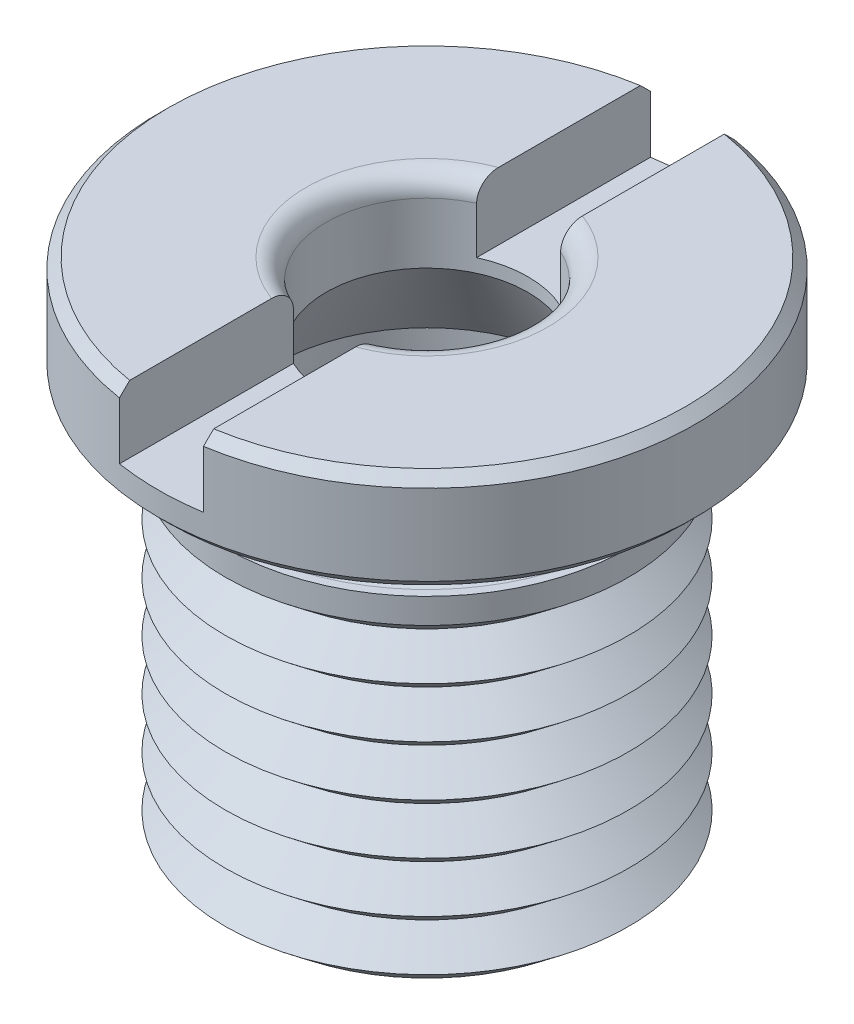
ISO-10303-21;
HEADER;
FILE_DESCRIPTION(('STEP AP214'),'2;1');
FILE_NAME('part.step','',(''),(''),'','','');
FILE_SCHEMA(('AUTOMOTIVE_DESIGN { 1 0 10303 214 1 1 1 1 }'));
ENDSEC;
DATA;
#1=APPLICATION_CONTEXT('core data for automotive mechanical design processes');
#2=APPLICATION_PROTOCOL_DEFINITION('international standard','automotive_design',2000,#1);
#3=PRODUCT_CONTEXT('',#1,'mechanical');
#4=PRODUCT('Part','Part','',(#3));
#5=PRODUCT_RELATED_PRODUCT_CATEGORY('part','',(#4));
#6=PRODUCT_DEFINITION_FORMATION('','',#4);
#7=PRODUCT_DEFINITION_CONTEXT('part definition',#1,'design');
#8=PRODUCT_DEFINITION('design','',#6,#7);
#9=PRODUCT_DEFINITION_SHAPE('','',#8);
#10=(LENGTH_UNIT() NAMED_UNIT(*) SI_UNIT(.MILLI.,.METRE.));
#11=(NAMED_UNIT(*) PLANE_ANGLE_UNIT() SI_UNIT($,.RADIAN.));
#12=(NAMED_UNIT(*) SI_UNIT($,.STERADIAN.) SOLID_ANGLE_UNIT());
#13=UNCERTAINTY_MEASURE_WITH_UNIT(LENGTH_MEASURE(1.E-05),#10,'distance_accuracy_value','');
#14=(GEOMETRIC_REPRESENTATION_CONTEXT(3) GLOBAL_UNCERTAINTY_ASSIGNED_CONTEXT((#13)) GLOBAL_UNIT_ASSIGNED_CONTEXT((#10,
#11,#12)) REPRESENTATION_CONTEXT('',''));
#15=CARTESIAN_POINT('',(0.,0.,0.));
#16=DIRECTION('',(0.,0.,1.));
#17=DIRECTION('',(1.,0.,0.));
#18=AXIS2_PLACEMENT_3D('',#15,#16,#17);
#19=CARTESIAN_POINT('',(0.,14.4,0.));
#20=DIRECTION('',(0.,-1.,0.));
#21=DIRECTION('',(0.,0.,-1.));
#22=AXIS2_PLACEMENT_3D('',#19,#20,#21);
#23=TOROIDAL_SURFACE('',#22,3.6,0.6);
#24=CARTESIAN_POINT('',(1.25,14.9999972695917,-3.37408810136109));
#25=CARTESIAN_POINT('',(1.25,15.0001015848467,-3.41141952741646));
#26=CARTESIAN_POINT('',(1.25,14.9971379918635,-3.44878537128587));
#27=CARTESIAN_POINT('',(1.25,14.9850416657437,-3.52254051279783));
#28=CARTESIAN_POINT('',(1.25,14.9759023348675,-3.55892872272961));
#29=CARTESIAN_POINT('',(1.25,14.9515467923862,-3.62968469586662));
#30=CARTESIAN_POINT('',(1.25,14.9363216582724,-3.66404940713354));
#31=CARTESIAN_POINT('',(1.25,14.9000908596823,-3.72957997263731));
#32=CARTESIAN_POINT('',(1.25,14.8790874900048,-3.76074709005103));
#33=CARTESIAN_POINT('',(1.25,14.8327336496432,-3.81766201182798));
#34=CARTESIAN_POINT('',(1.25,14.8075848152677,-3.84357384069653));
#35=CARTESIAN_POINT('',(1.25,14.7530800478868,-3.89051816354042));
#36=CARTESIAN_POINT('',(1.25,14.7237253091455,-3.91155203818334));
#37=CARTESIAN_POINT('',(1.25,14.6633233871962,-3.94697560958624));
#38=CARTESIAN_POINT('',(1.25,14.6324474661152,-3.96165753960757));
#39=CARTESIAN_POINT('',(1.25,14.5686023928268,-3.98538885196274));
#40=CARTESIAN_POINT('',(1.25,14.5356337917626,-3.99443971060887));
#41=CARTESIAN_POINT('',(1.25,14.4699230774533,-4.0063320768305));
#42=CARTESIAN_POINT('',(1.25,14.4372220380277,-4.00940142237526));
#43=CARTESIAN_POINT('',(1.25,14.3717777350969,-4.00991482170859));
#44=CARTESIAN_POINT('',(1.25,14.3390344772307,-4.00735956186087));
#45=CARTESIAN_POINT('',(1.25,14.2749447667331,-3.99679642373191));
#46=CARTESIAN_POINT('',(1.25,14.243584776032,-3.98887029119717));
#47=CARTESIAN_POINT('',(1.25,14.1826188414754,-3.96792220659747));
#48=CARTESIAN_POINT('',(1.25,14.1530129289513,-3.95490016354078));
#49=CARTESIAN_POINT('',(1.25,14.0960149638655,-3.92401656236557));
#50=CARTESIAN_POINT('',(1.25,14.0686515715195,-3.90610219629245));
#51=CARTESIAN_POINT('',(1.25,14.017195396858,-3.86607471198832));
#52=CARTESIAN_POINT('',(1.25,13.993103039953,-3.84396104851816));
#53=CARTESIAN_POINT('',(1.25,13.9479780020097,-3.79538391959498));
#54=CARTESIAN_POINT('',(1.25,13.9270770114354,-3.76879823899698));
#55=CARTESIAN_POINT('',(1.25,13.8897920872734,-3.71263216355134));
#56=CARTESIAN_POINT('',(1.25,13.8734091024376,-3.68305114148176));
#57=CARTESIAN_POINT('',(1.25,13.8447708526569,-3.62020316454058));
#58=CARTESIAN_POINT('',(1.25,13.8327557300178,-3.58682682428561));
#59=CARTESIAN_POINT('',(1.25,13.8141977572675,-3.5185875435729));
#60=CARTESIAN_POINT('',(1.25,13.8076562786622,-3.48372423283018));
#61=CARTESIAN_POINT('',(1.25,13.7999105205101,-3.41161787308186));
#62=CARTESIAN_POINT('',(1.25,13.7989938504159,-3.37434382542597));
#63=CARTESIAN_POINT('',(1.25,13.8032091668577,-3.30013666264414));
#64=CARTESIAN_POINT('',(1.25,13.8083425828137,-3.26320363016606));
#65=CARTESIAN_POINT('',(1.25,13.8247826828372,-3.18941469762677));
#66=CARTESIAN_POINT('',(1.25,13.836292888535,-3.15260392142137));
#67=CARTESIAN_POINT('',(1.25,13.8653593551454,-3.08144115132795));
#68=CARTESIAN_POINT('',(1.25,13.8829163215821,-3.04708944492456));
#69=CARTESIAN_POINT('',(1.25,13.9235905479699,-2.98211592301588));
#70=CARTESIAN_POINT('',(1.25,13.946675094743,-2.9514737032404));
#71=CARTESIAN_POINT('',(1.25,13.9979527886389,-2.89479759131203));
#72=CARTESIAN_POINT('',(1.25,14.0261443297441,-2.86876225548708));
#73=CARTESIAN_POINT('',(1.25,14.0851288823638,-2.82378264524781));
#74=CARTESIAN_POINT('',(1.25,14.1156724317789,-2.80451209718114));
#75=CARTESIAN_POINT('',(1.25,14.1797971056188,-2.77195361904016));
#76=CARTESIAN_POINT('',(1.25,14.2133760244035,-2.75866138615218));
#77=CARTESIAN_POINT('',(1.25,14.2794173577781,-2.73964963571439));
#78=CARTESIAN_POINT('',(1.25,14.311717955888,-2.73336661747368));
#79=CARTESIAN_POINT('',(1.25,14.3769184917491,-2.72668559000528));
#80=CARTESIAN_POINT('',(1.25,14.4098181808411,-2.72628519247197));
#81=CARTESIAN_POINT('',(1.25,14.473251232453,-2.73123575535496));
#82=CARTESIAN_POINT('',(1.25,14.5038112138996,-2.73625466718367));
#83=CARTESIAN_POINT('',(1.25,14.5636694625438,-2.75129473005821));
#84=CARTESIAN_POINT('',(1.25,14.5929677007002,-2.76131599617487));
#85=CARTESIAN_POINT('',(1.25,14.6499036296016,-2.78609169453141));
#86=CARTESIAN_POINT('',(1.25,14.6775168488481,-2.80090210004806));
#87=CARTESIAN_POINT('',(1.25,14.7300775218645,-2.83466207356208));
#88=CARTESIAN_POINT('',(1.25,14.7550243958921,-2.85361253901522));
#89=CARTESIAN_POINT('',(1.25,14.8033837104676,-2.89646835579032));
#90=CARTESIAN_POINT('',(1.25,14.8265738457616,-2.92062426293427));
#91=CARTESIAN_POINT('',(1.25,14.8689518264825,-2.97223102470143));
#92=CARTESIAN_POINT('',(1.25,14.8881372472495,-2.99968385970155));
#93=CARTESIAN_POINT('',(1.25,14.9235959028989,-3.05953938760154));
#94=CARTESIAN_POINT('',(1.25,14.9394948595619,-3.09216382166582));
#95=CARTESIAN_POINT('',(1.25,14.9659050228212,-3.1594966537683));
#96=CARTESIAN_POINT('',(1.25,14.9764206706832,-3.19420330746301));
#97=CARTESIAN_POINT('',(1.25,14.9893354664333,-3.25323276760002));
#98=CARTESIAN_POINT('',(1.25,14.9932650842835,-3.27723191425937));
#99=CARTESIAN_POINT('',(1.25,14.99856209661,-3.32551187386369));
#100=CARTESIAN_POINT('',(1.25,14.9999293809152,-3.34979269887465));
#101=CARTESIAN_POINT('',(1.25,14.9999972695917,-3.37408810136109));
#102=B_SPLINE_CURVE_WITH_KNOTS('',3,(#24,#25,#26,#27,#28,#29,#30,#31,#32,#33,#34,#35,#36,#37,
#38,#39,#40,#41,#42,#43,#44,#45,#46,#47,#48,#49,#50,#51,#52,#53,#54,#55,#56,#57,#58,#59,#60,#61,
#62,#63,#64,#65,#66,#67,#68,#69,#70,#71,#72,#73,#74,#75,#76,#77,#78,#79,#80,#81,#82,#83,#84,#85,
#86,#87,#88,#89,#90,#91,#92,#93,#94,#95,#96,#97,#98,#99,#100,#101),.UNSPECIFIED.,.T.,.F.,(4,2,2,
2,2,2,2,2,2,2,2,2,2,2,2,2,2,2,2,2,2,2,2,2,2,2,2,2,2,2,2,2,2,2,2,2,2,2,4),(0.,0.111909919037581,
0.223939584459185,0.336134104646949,0.448284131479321,0.556057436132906,0.663800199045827,
0.765852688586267,0.867878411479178,0.965935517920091,1.06398065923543,1.16056609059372,
1.25715324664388,1.35482725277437,1.45251394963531,1.55351805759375,1.65454335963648,
1.7604933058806,1.86646979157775,1.97782279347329,2.08920210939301,2.20435999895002,
2.31953132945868,2.43403720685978,2.54850713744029,2.65626511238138,2.76394540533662,
2.8621490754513,2.9603128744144,3.05278632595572,3.14526190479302,3.23885992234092,
3.3324782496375,3.43251207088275,3.53260628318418,3.6410148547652,3.74933384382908,
3.82216201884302,3.894993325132),.UNSPECIFIED.);
#103=CARTESIAN_POINT('',(1.25,14.3999999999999,-2.72717802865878));
#104=VERTEX_POINT('',#103);
#105=CARTESIAN_POINT('',(1.25,15.,-3.37601836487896));
#106=VERTEX_POINT('',#105);
#107=EDGE_CURVE('E281',#104,#106,#102,.T.);
#108=ORIENTED_EDGE('',*,*,#107,.F.);
#109=CARTESIAN_POINT('',(0.,14.4,0.));
#110=DIRECTION('',(0.,-1.,0.));
#111=DIRECTION('',(0.,0.,-1.));
#112=AXIS2_PLACEMENT_3D('',#109,#110,#111);
#113=CIRCLE('',#112,3.);
#114=CARTESIAN_POINT('',(1.25,14.4,2.72717802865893));
#115=VERTEX_POINT('',#114);
#116=EDGE_CURVE('E181',#104,#115,#113,.T.);
#117=ORIENTED_EDGE('',*,*,#116,.T.);
#118=CARTESIAN_POINT('',(1.25,14.5860757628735,2.75968690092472));
#119=CARTESIAN_POINT('',(1.25,14.556946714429,2.74925669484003));
#120=CARTESIAN_POINT('',(1.25,14.5269438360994,2.74122146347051));
#121=CARTESIAN_POINT('',(1.25,14.4659995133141,2.73030467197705));
#122=CARTESIAN_POINT('',(1.25,14.4350576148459,2.7274256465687));
#123=CARTESIAN_POINT('',(1.25,14.3731273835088,2.72696111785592));
#124=CARTESIAN_POINT('',(1.25,14.3421390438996,2.72937647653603));
#125=CARTESIAN_POINT('',(1.25,14.2810178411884,2.73938914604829));
#126=CARTESIAN_POINT('',(1.25,14.2508849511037,2.74698629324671));
#127=CARTESIAN_POINT('',(1.25,14.1923098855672,2.76701615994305));
#128=CARTESIAN_POINT('',(1.25,14.1638662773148,2.77944471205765));
#129=CARTESIAN_POINT('',(1.25,14.1093105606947,2.80864654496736));
#130=CARTESIAN_POINT('',(1.25,14.0831989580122,2.82542076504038));
#131=CARTESIAN_POINT('',(1.25,14.0324051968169,2.86382516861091));
#132=CARTESIAN_POINT('',(1.25,14.0078934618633,2.88568035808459));
#133=CARTESIAN_POINT('',(1.25,13.9625370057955,2.9329082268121));
#134=CARTESIAN_POINT('',(1.25,13.9416935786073,2.95828214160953));
#135=CARTESIAN_POINT('',(1.25,13.9024491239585,3.01408852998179));
#136=CARTESIAN_POINT('',(1.25,13.8843968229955,3.04476640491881));
#137=CARTESIAN_POINT('',(1.25,13.8533309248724,3.10857587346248));
#138=CARTESIAN_POINT('',(1.25,13.8403190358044,3.14170829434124));
#139=CARTESIAN_POINT('',(1.25,13.8189021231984,3.21180283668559));
#140=CARTESIAN_POINT('',(1.25,13.8108520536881,3.24887386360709));
#141=CARTESIAN_POINT('',(1.25,13.800950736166,3.32383919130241));
#142=CARTESIAN_POINT('',(1.25,13.7991005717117,3.36173363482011));
#143=CARTESIAN_POINT('',(1.25,13.8017360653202,3.43806305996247));
#144=CARTESIAN_POINT('',(1.25,13.8063481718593,3.47649384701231));
#145=CARTESIAN_POINT('',(1.25,13.8221273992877,3.55199146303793));
#146=CARTESIAN_POINT('',(1.25,13.8332939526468,3.58905840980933));
#147=CARTESIAN_POINT('',(1.25,13.861639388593,3.65973603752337));
#148=CARTESIAN_POINT('',(1.25,13.8786589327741,3.6934104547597));
#149=CARTESIAN_POINT('',(1.25,13.9183987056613,3.75721376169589));
#150=CARTESIAN_POINT('',(1.25,13.9411172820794,3.78734367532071));
#151=CARTESIAN_POINT('',(1.25,13.9903855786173,3.8415530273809));
#152=CARTESIAN_POINT('',(1.25,14.0166831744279,3.86586152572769));
#153=CARTESIAN_POINT('',(1.25,14.0731778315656,3.90942436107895));
#154=CARTESIAN_POINT('',(1.25,14.1033736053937,3.9286803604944));
#155=CARTESIAN_POINT('',(1.25,14.1651066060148,3.96055130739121));
#156=CARTESIAN_POINT('',(1.25,14.1964927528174,3.97345918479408));
#157=CARTESIAN_POINT('',(1.25,14.2610352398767,3.99360087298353));
#158=CARTESIAN_POINT('',(1.25,14.2941911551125,4.00083603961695));
#159=CARTESIAN_POINT('',(1.25,14.3600580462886,4.00920973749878));
#160=CARTESIAN_POINT('',(1.25,14.3927426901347,4.01055658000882));
#161=CARTESIAN_POINT('',(1.25,14.4578634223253,4.00767678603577));
#162=CARTESIAN_POINT('',(1.25,14.4902995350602,4.0034507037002));
#163=CARTESIAN_POINT('',(1.25,14.5536391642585,3.98965204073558));
#164=CARTESIAN_POINT('',(1.25,14.584555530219,3.9801382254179));
#165=CARTESIAN_POINT('',(1.25,14.6443862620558,3.95612971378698));
#166=CARTESIAN_POINT('',(1.25,14.6733005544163,3.94163483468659));
#167=CARTESIAN_POINT('',(1.25,14.7287960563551,3.90788291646));
#168=CARTESIAN_POINT('',(1.25,14.7553356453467,3.88855754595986));
#169=CARTESIAN_POINT('',(1.25,14.8049376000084,3.84587162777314));
#170=CARTESIAN_POINT('',(1.25,14.8279994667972,3.82251050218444));
#171=CARTESIAN_POINT('',(1.25,14.870917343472,3.77151807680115));
#172=CARTESIAN_POINT('',(1.25,14.8906240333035,3.74376121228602));
#173=CARTESIAN_POINT('',(1.25,14.9253554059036,3.68546170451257));
#174=CARTESIAN_POINT('',(1.25,14.9403790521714,3.65491844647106));
#175=CARTESIAN_POINT('',(1.25,14.9661173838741,3.59028975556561));
#176=CARTESIAN_POINT('',(1.25,14.9765790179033,3.55610356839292));
#177=CARTESIAN_POINT('',(1.25,14.9919147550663,3.48650122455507));
#178=CARTESIAN_POINT('',(1.25,14.9967874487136,3.4510847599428));
#179=CARTESIAN_POINT('',(1.25,15.0010243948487,3.37815974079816));
#180=CARTESIAN_POINT('',(1.25,15.0001036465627,3.34063450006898));
#181=CARTESIAN_POINT('',(1.25,14.9921694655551,3.26623135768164));
#182=CARTESIAN_POINT('',(1.25,14.9851548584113,3.22935358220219));
#183=CARTESIAN_POINT('',(1.25,14.9649213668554,3.15617040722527));
#184=CARTESIAN_POINT('',(1.25,14.9515269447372,3.11991333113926));
#185=CARTESIAN_POINT('',(1.25,14.9187600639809,3.05018425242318));
#186=CARTESIAN_POINT('',(1.25,14.899385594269,3.01671319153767));
#187=CARTESIAN_POINT('',(1.25,14.8553627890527,2.95408084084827));
#188=CARTESIAN_POINT('',(1.25,14.8307862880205,2.92486918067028));
#189=CARTESIAN_POINT('',(1.25,14.7767876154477,2.87137618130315));
#190=CARTESIAN_POINT('',(1.25,14.74737400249,2.84708630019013));
#191=CARTESIAN_POINT('',(1.25,14.6957845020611,2.81213904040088));
#192=CARTESIAN_POINT('',(1.25,14.6747876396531,2.79971441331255));
#193=CARTESIAN_POINT('',(1.25,14.6313995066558,2.77759427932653));
#194=CARTESIAN_POINT('',(1.25,14.6090084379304,2.76789837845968));
#195=CARTESIAN_POINT('',(1.25,14.5860757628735,2.75968690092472));
#196=B_SPLINE_CURVE_WITH_KNOTS('',3,(#118,#119,#120,#121,#122,#123,#124,#125,#126,#127,#128,
#129,#130,#131,#132,#133,#134,#135,#136,#137,#138,#139,#140,#141,#142,#143,#144,#145,#146,#147,
#148,#149,#150,#151,#152,#153,#154,#155,#156,#157,#158,#159,#160,#161,#162,#163,#164,#165,#166,
#167,#168,#169,#170,#171,#172,#173,#174,#175,#176,#177,#178,#179,#180,#181,#182,#183,#184,#185,
#186,#187,#188,#189,#190,#191,#192,#193,#194,#195),.UNSPECIFIED.,.T.,.F.,(4,2,2,2,2,2,2,2,2,2,2,
2,2,2,2,2,2,2,2,2,2,2,2,2,2,2,2,2,2,2,2,2,2,2,2,2,2,2,4),(0.,0.0927353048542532,
0.185516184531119,0.278312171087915,0.371105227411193,0.463818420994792,0.556551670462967,
0.654656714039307,0.752796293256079,0.859121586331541,0.96548287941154,1.07876664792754,
1.19207021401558,1.30762203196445,1.42316384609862,1.53578106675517,1.64836567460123,
1.7552516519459,1.86210241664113,1.96340469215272,2.06468274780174,2.16234730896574,
2.26000215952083,2.3565928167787,2.45318701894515,2.55123371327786,2.64929445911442,
2.75096610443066,2.852660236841,2.95943985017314,3.0662463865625,3.17834686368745,
3.29046894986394,3.40587184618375,3.52131359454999,3.63525460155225,3.7489961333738,
3.82201519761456,3.89502371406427),.UNSPECIFIED.);
#197=CARTESIAN_POINT('',(1.25,15.,3.37601836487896));
#198=VERTEX_POINT('',#197);
#199=EDGE_CURVE('E270',#198,#115,#196,.T.);
#200=ORIENTED_EDGE('',*,*,#199,.F.);
#201=CARTESIAN_POINT('',(0.,15.,0.));
#202=DIRECTION('',(0.,-1.,0.));
#203=DIRECTION('',(0.,0.,-1.));
#204=AXIS2_PLACEMENT_3D('',#201,#202,#203);
#205=CIRCLE('',#204,3.6);
#206=EDGE_CURVE('E176',#106,#198,#205,.T.);
#207=ORIENTED_EDGE('',*,*,#206,.F.);
#208=EDGE_LOOP('',(#108,#117,#200,#207));
#209=FACE_BOUND('',#208,.T.);
#210=ADVANCED_FACE('F37',(#209),#23,.T.);
#211=CARTESIAN_POINT('',(7.7,15.,0.));
#212=DIRECTION('',(0.,1.,0.));
#213=DIRECTION('',(0.,0.,1.));
#214=AXIS2_PLACEMENT_3D('',#211,#212,#213);
#215=PLANE('',#214);
#216=DIRECTION('',(0.,0.,-1.));
#217=VECTOR('',#216,1.);
#218=CARTESIAN_POINT('',(1.25,15.,8.));
#219=LINE('',#218,#217);
#220=CARTESIAN_POINT('',(1.25,15.,7.59786154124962));
#221=VERTEX_POINT('',#220);
#222=EDGE_CURVE('E360',#221,#198,#219,.T.);
#223=ORIENTED_EDGE('',*,*,#222,.F.);
#224=CARTESIAN_POINT('',(0.,15.,0.));
#225=DIRECTION('',(0.,-1.,0.));
#226=DIRECTION('',(0.,0.,-1.));
#227=AXIS2_PLACEMENT_3D('',#224,#225,#226);
#228=CIRCLE('',#227,7.7);
#229=CARTESIAN_POINT('',(1.25,15.,-7.59786154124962));
#230=VERTEX_POINT('',#229);
#231=EDGE_CURVE('E165',#230,#221,#228,.T.);
#232=ORIENTED_EDGE('',*,*,#231,.F.);
#233=EDGE_CURVE('E359',#106,#230,#219,.T.);
#234=ORIENTED_EDGE('',*,*,#233,.F.);
#235=ORIENTED_EDGE('',*,*,#206,.T.);
#236=EDGE_LOOP('',(#223,#232,#234,#235));
#237=FACE_BOUND('',#236,.T.);
#238=ADVANCED_FACE('F332',(#237),#215,.T.);
#239=CARTESIAN_POINT('',(0.,14.7,0.));
#240=DIRECTION('',(0.,-1.,0.));
#241=DIRECTION('',(0.,0.,-1.));
#242=AXIS2_PLACEMENT_3D('',#239,#240,#241);
#243=CONICAL_SURFACE('',#242,8.,0.785398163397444);
#244=CARTESIAN_POINT('',(1.25,5.09811264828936,17.5574468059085));
#245=CARTESIAN_POINT('',(1.25,5.70610155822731,16.9479065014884));
#246=CARTESIAN_POINT('',(1.25,6.3140222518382,16.3382981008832));
#247=CARTESIAN_POINT('',(1.25,7.52965506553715,15.1188394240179));
#248=CARTESIAN_POINT('',(1.25,8.13736717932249,14.5089891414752));
#249=CARTESIAN_POINT('',(1.25,9.35286941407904,13.2885807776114));
#250=CARTESIAN_POINT('',(1.25,9.96065933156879,12.6780224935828));
#251=CARTESIAN_POINT('',(1.25,11.1757391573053,11.4564416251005));
#252=CARTESIAN_POINT('',(1.25,11.783029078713,10.8454190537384));
#253=CARTESIAN_POINT('',(1.25,12.9940460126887,9.62541460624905));
#254=CARTESIAN_POINT('',(1.25,13.5977765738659,9.01643625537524));
#255=CARTESIAN_POINT('',(1.25,14.5023510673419,8.10190768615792));
#256=CARTESIAN_POINT('',(1.25,14.8037182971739,7.79687516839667));
#257=CARTESIAN_POINT('',(1.25,15.4059512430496,7.18632006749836));
#258=CARTESIAN_POINT('',(1.25,15.7068169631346,6.88079748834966));
#259=CARTESIAN_POINT('',(1.25,16.3076957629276,6.26915572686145));
#260=CARTESIAN_POINT('',(1.25,16.6077091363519,5.96303683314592));
#261=CARTESIAN_POINT('',(1.25,17.2066202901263,5.34968886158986));
#262=CARTESIAN_POINT('',(1.25,17.5055180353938,5.04245974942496));
#263=CARTESIAN_POINT('',(1.25,17.9524056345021,4.58024752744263));
#264=CARTESIAN_POINT('',(1.25,18.1011144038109,4.42595978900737));
#265=CARTESIAN_POINT('',(1.25,18.3978758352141,4.11675492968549));
#266=CARTESIAN_POINT('',(1.25,18.5459284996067,3.961837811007));
#267=CARTESIAN_POINT('',(1.25,18.8411138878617,3.65114384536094));
#268=CARTESIAN_POINT('',(1.25,18.9882466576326,3.49536704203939));
#269=CARTESIAN_POINT('',(1.25,19.2811902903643,3.18257646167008));
#270=CARTESIAN_POINT('',(1.25,19.4270011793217,3.02556270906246));
#271=CARTESIAN_POINT('',(1.25,19.6113127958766,2.82449624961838));
#272=CARTESIAN_POINT('',(1.25,19.6507595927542,2.78131063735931));
#273=CARTESIAN_POINT('',(1.25,19.7294767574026,2.69477869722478));
#274=CARTESIAN_POINT('',(1.25,19.7687471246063,2.65143236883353));
#275=CARTESIAN_POINT('',(1.25,19.8862614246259,2.52111862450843));
#276=CARTESIAN_POINT('',(1.25,19.9642053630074,2.43387992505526));
#277=CARTESIAN_POINT('',(1.25,20.1191792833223,2.25828363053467));
#278=CARTESIAN_POINT('',(1.25,20.1962071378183,2.16992415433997));
#279=CARTESIAN_POINT('',(1.25,20.3487798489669,1.99194458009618));
#280=CARTESIAN_POINT('',(1.25,20.424324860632,1.90232461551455));
#281=CARTESIAN_POINT('',(1.25,20.5637312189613,1.73295981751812));
#282=CARTESIAN_POINT('',(1.25,20.6278469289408,1.65342512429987));
#283=CARTESIAN_POINT('',(1.25,20.7537877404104,1.49256596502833));
#284=CARTESIAN_POINT('',(1.25,20.8156131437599,1.41124173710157));
#285=CARTESIAN_POINT('',(1.25,20.9358293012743,1.24619541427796));
#286=CARTESIAN_POINT('',(1.25,20.9942234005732,1.1624757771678));
#287=CARTESIAN_POINT('',(1.25,21.1057491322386,0.991632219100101));
#288=CARTESIAN_POINT('',(1.25,21.158885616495,0.904511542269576));
#289=CARTESIAN_POINT('',(1.25,21.2510675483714,0.735747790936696));
#290=CARTESIAN_POINT('',(1.25,21.2910291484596,0.654614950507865));
#291=CARTESIAN_POINT('',(1.25,21.360287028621,0.487866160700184));
#292=CARTESIAN_POINT('',(1.25,21.3896104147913,0.402262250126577));
#293=CARTESIAN_POINT('',(1.25,21.419747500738,0.278856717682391));
#294=CARTESIAN_POINT('',(1.25,21.4271738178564,0.242655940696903));
#295=CARTESIAN_POINT('',(1.25,21.4390345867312,0.169775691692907));
#296=CARTESIAN_POINT('',(1.25,21.4434704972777,0.133096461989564));
#297=CARTESIAN_POINT('',(1.25,21.4491197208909,0.0595270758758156));
#298=CARTESIAN_POINT('',(1.25,21.4503366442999,0.0226372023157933));
#299=CARTESIAN_POINT('',(1.25,21.4495013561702,-0.0510981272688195));
#300=CARTESIAN_POINT('',(1.25,21.4474490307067,-0.0879435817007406));
#301=CARTESIAN_POINT('',(1.25,21.4365362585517,-0.197727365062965));
#302=CARTESIAN_POINT('',(1.25,21.4229436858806,-0.270237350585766));
#303=CARTESIAN_POINT('',(1.25,21.3948795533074,-0.376882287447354));
#304=CARTESIAN_POINT('',(1.25,21.3842261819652,-0.41212305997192));
#305=CARTESIAN_POINT('',(1.25,21.3607350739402,-0.481873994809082));
#306=CARTESIAN_POINT('',(1.25,21.3478974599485,-0.516384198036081));
#307=CARTESIAN_POINT('',(1.25,21.3142289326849,-0.599927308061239));
#308=CARTESIAN_POINT('',(1.25,21.2923911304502,-0.648551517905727));
#309=CARTESIAN_POINT('',(1.25,21.245751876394,-0.744368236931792));
#310=CARTESIAN_POINT('',(1.25,21.2209487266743,-0.79155990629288));
#311=CARTESIAN_POINT('',(1.25,21.1430765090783,-0.931429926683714));
#312=CARTESIAN_POINT('',(1.25,21.0866267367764,-1.02221540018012));
#313=CARTESIAN_POINT('',(1.25,20.967851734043,-1.20096117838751));
#314=CARTESIAN_POINT('',(1.25,20.9054769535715,-1.28888755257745));
#315=CARTESIAN_POINT('',(1.25,20.8093439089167,-1.41877207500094));
#316=CARTESIAN_POINT('',(1.25,20.7768923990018,-1.46170624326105));
#317=CARTESIAN_POINT('',(1.25,20.7112738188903,-1.54702165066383));
#318=CARTESIAN_POINT('',(1.25,20.6781067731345,-1.58940290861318));
#319=CARTESIAN_POINT('',(1.25,20.5680594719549,-1.72804302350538));
#320=CARTESIAN_POINT('',(1.25,20.4899475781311,-1.82332355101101));
#321=CARTESIAN_POINT('',(1.25,20.3317078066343,-2.01219980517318));
#322=CARTESIAN_POINT('',(1.25,20.2515797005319,-2.10579533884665));
#323=CARTESIAN_POINT('',(1.25,20.0898882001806,-2.29178888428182));
#324=CARTESIAN_POINT('',(1.25,20.0083243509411,-2.38418649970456));
#325=CARTESIAN_POINT('',(1.25,19.8441705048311,-2.56806685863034));
#326=CARTESIAN_POINT('',(1.25,19.7615804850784,-2.65954958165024));
#327=CARTESIAN_POINT('',(1.25,19.5124490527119,-2.93321359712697));
#328=CARTESIAN_POINT('',(1.25,19.3447692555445,-3.11435746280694));
#329=CARTESIAN_POINT('',(1.25,19.007640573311,-3.47491618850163));
#330=CARTESIAN_POINT('',(1.25,18.8381920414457,-3.65433138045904));
#331=CARTESIAN_POINT('',(1.25,18.4992884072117,-4.01079886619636));
#332=CARTESIAN_POINT('',(1.25,18.3298414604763,-4.1878589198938));
#333=CARTESIAN_POINT('',(1.25,17.9901382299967,-4.54121713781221));
#334=CARTESIAN_POINT('',(1.25,17.8198819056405,-4.71751526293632));
#335=CARTESIAN_POINT('',(1.25,17.478919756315,-5.06942541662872));
#336=CARTESIAN_POINT('',(1.25,17.3082143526,-5.24503785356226));
#337=CARTESIAN_POINT('',(1.25,16.9663782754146,-5.59584260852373));
#338=CARTESIAN_POINT('',(1.25,16.7952476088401,-5.77103493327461));
#339=CARTESIAN_POINT('',(1.25,16.1495622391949,-6.43085103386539));
#340=CARTESIAN_POINT('',(1.25,15.6739523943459,-6.9144419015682));
#341=CARTESIAN_POINT('',(1.25,14.7214780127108,-7.88039194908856));
#342=CARTESIAN_POINT('',(1.25,14.244613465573,-8.36275111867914));
#343=CARTESIAN_POINT('',(1.25,13.289975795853,-9.32687580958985));
#344=CARTESIAN_POINT('',(1.25,12.8122024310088,-9.80864109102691));
#345=CARTESIAN_POINT('',(1.25,11.8561760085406,-10.7716925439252));
#346=CARTESIAN_POINT('',(1.25,11.3779229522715,-11.252978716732));
#347=CARTESIAN_POINT('',(1.25,10.416427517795,-12.2199139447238));
#348=CARTESIAN_POINT('',(1.25,9.93318193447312,-12.7055598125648));
#349=CARTESIAN_POINT('',(1.25,8.96645454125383,-13.6766172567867));
#350=CARTESIAN_POINT('',(1.25,8.48297273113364,-14.1620288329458));
#351=CARTESIAN_POINT('',(1.25,7.51600145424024,-15.1325153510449));
#352=CARTESIAN_POINT('',(1.25,7.03251204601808,-15.6175903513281));
#353=CARTESIAN_POINT('',(1.25,6.06540141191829,-16.5876079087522));
#354=CARTESIAN_POINT('',(1.25,5.58178018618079,-17.0725504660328));
#355=CARTESIAN_POINT('',(1.25,5.09811264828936,-17.5574468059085));
#356=B_SPLINE_CURVE_WITH_KNOTS('',3,(#244,#245,#246,#247,#248,#249,#250,#251,#252,#253,#254,
#255,#256,#257,#258,#259,#260,#261,#262,#263,#264,#265,#266,#267,#268,#269,#270,#271,#272,#273,
#274,#275,#276,#277,#278,#279,#280,#281,#282,#283,#284,#285,#286,#287,#288,#289,#290,#291,#292,
#293,#294,#295,#296,#297,#298,#299,#300,#301,#302,#303,#304,#305,#306,#307,#308,#309,#310,#311,
#312,#313,#314,#315,#316,#317,#318,#319,#320,#321,#322,#323,#324,#325,#326,#327,#328,#329,#330,
#331,#332,#333,#334,#335,#336,#337,#338,#339,#340,#341,#342,#343,#344,#345,#346,#347,#348,#349,
#350,#351,#352,#353,#354,#355),.UNSPECIFIED.,.F.,.F.,(4,2,2,2,2,2,2,2,2,2,2,2,2,2,2,2,2,2,2,2,2,
2,2,2,2,2,2,2,2,2,2,2,2,2,2,2,2,2,2,2,2,2,2,2,2,2,2,2,2,2,2,2,2,2,2,4),(0.,2.58277163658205,
5.16561544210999,7.75012873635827,10.3345716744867,12.9071383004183,14.1935295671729,
15.4799104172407,16.7657750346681,18.051679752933,18.6945400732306,19.3373981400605,
19.9802238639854,20.623036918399,20.7985056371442,20.9739749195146,21.3249276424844,
21.6765787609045,22.0281929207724,22.3346442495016,22.6410550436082,22.9471619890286,
23.2529837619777,23.5238896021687,23.7941002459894,23.9048588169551,24.0155633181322,
24.1261436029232,24.2367277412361,24.4569341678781,24.5673336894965,24.6777270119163,
24.8374992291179,24.9973633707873,25.3177036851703,25.641009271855,25.8024581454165,
25.9639015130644,26.3334722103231,26.7030849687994,27.0728170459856,27.4425573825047,
28.183050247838,28.9233979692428,29.6586237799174,30.3938868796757,31.1286107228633,
31.8633227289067,33.8981593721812,35.9330128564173,37.9685186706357,40.004018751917,
42.0593540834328,44.1146913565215,46.169329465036,48.2239653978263),.UNSPECIFIED.);
#357=CARTESIAN_POINT('',(1.25,14.7,7.90174031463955));
#358=VERTEX_POINT('',#357);
#359=EDGE_CURVE('E275',#358,#221,#356,.T.);
#360=ORIENTED_EDGE('',*,*,#359,.F.);
#361=CARTESIAN_POINT('',(0.,14.7,0.));
#362=DIRECTION('',(0.,-1.,0.));
#363=DIRECTION('',(0.,0.,-1.));
#364=AXIS2_PLACEMENT_3D('',#361,#362,#363);
#365=CIRCLE('',#364,8.);
#366=CARTESIAN_POINT('',(1.25,14.7,-7.90174031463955));
#367=VERTEX_POINT('',#366);
#368=EDGE_CURVE('E153',#367,#358,#365,.T.);
#369=ORIENTED_EDGE('',*,*,#368,.F.);
#370=EDGE_CURVE('E276',#230,#367,#356,.T.);
#371=ORIENTED_EDGE('',*,*,#370,.F.);
#372=ORIENTED_EDGE('',*,*,#231,.T.);
#373=EDGE_LOOP('',(#360,#369,#371,#372));
#374=FACE_BOUND('',#373,.T.);
#375=ADVANCED_FACE('F330',(#374),#243,.T.);
#376=CARTESIAN_POINT('',(0.,0.,0.));
#377=DIRECTION('',(0.,-1.,0.));
#378=DIRECTION('',(0.,0.,-1.));
#379=AXIS2_PLACEMENT_3D('',#376,#377,#378);
#380=CYLINDRICAL_SURFACE('',#379,4.5);
#381=CARTESIAN_POINT('',(0.,0.,0.));
#382=DIRECTION('',(0.,-1.,0.));
#383=DIRECTION('',(0.,0.,-1.));
#384=AXIS2_PLACEMENT_3D('',#381,#382,#383);
#385=CIRCLE('',#384,4.5);
#386=CARTESIAN_POINT('',(0.,0.,-4.5));
#387=VERTEX_POINT('',#386);
#388=EDGE_CURVE('E287',#387,#387,#385,.T.);
#389=ORIENTED_EDGE('',*,*,#388,.T.);
#390=EDGE_LOOP('',(#389));
#391=FACE_BOUND('',#390,.T.);
#392=CARTESIAN_POINT('',(0.,10.,0.));
#393=DIRECTION('',(0.,-1.,0.));
#394=DIRECTION('',(0.,0.,-1.));
#395=AXIS2_PLACEMENT_3D('',#392,#393,#394);
#396=CIRCLE('',#395,4.5);
#397=CARTESIAN_POINT('',(0.,10.,-4.5));
#398=VERTEX_POINT('',#397);
#399=EDGE_CURVE('E188',#398,#398,#396,.T.);
#400=ORIENTED_EDGE('',*,*,#399,.F.);
#401=EDGE_LOOP('',(#400));
#402=FACE_BOUND('',#401,.T.);
#403=ADVANCED_FACE('F39',(#391,#402),#380,.F.);
#404=CARTESIAN_POINT('',(0.,12.5980762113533,0.));
#405=DIRECTION('',(0.,-1.,0.));
#406=DIRECTION('',(0.,0.,-1.));
#407=AXIS2_PLACEMENT_3D('',#404,#405,#406);
#408=CONICAL_SURFACE('',#407,3.,0.5235987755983);
#409=ORIENTED_EDGE('',*,*,#399,.T.);
#410=EDGE_LOOP('',(#409));
#411=FACE_BOUND('',#410,.T.);
#412=CARTESIAN_POINT('',(0.,12.5980762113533,0.));
#413=DIRECTION('',(0.,-1.,0.));
#414=DIRECTION('',(0.,0.,-1.));
#415=AXIS2_PLACEMENT_3D('',#412,#413,#414);
#416=CIRCLE('',#415,3.);
#417=CARTESIAN_POINT('',(0.,12.5980762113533,-3.));
#418=VERTEX_POINT('',#417);
#419=EDGE_CURVE('E185',#418,#418,#416,.T.);
#420=ORIENTED_EDGE('',*,*,#419,.F.);
#421=EDGE_LOOP('',(#420));
#422=FACE_BOUND('',#421,.T.);
#423=ADVANCED_FACE('F789',(#411,#422),#408,.F.);
#424=CARTESIAN_POINT('',(0.,0.,0.));
#425=DIRECTION('',(0.,-1.,0.));
#426=DIRECTION('',(0.,0.,-1.));
#427=AXIS2_PLACEMENT_3D('',#424,#425,#426);
#428=CYLINDRICAL_SURFACE('',#427,3.);
#429=DIRECTION('',(0.,-1.,0.));
#430=VECTOR('',#429,1.);
#431=CARTESIAN_POINT('',(1.25,0.,2.72717802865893));
#432=LINE('',#431,#430);
#433=CARTESIAN_POINT('',(1.25,13.,2.72717802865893));
#434=VERTEX_POINT('',#433);
#435=EDGE_CURVE('E145',#115,#434,#432,.T.);
#436=ORIENTED_EDGE('',*,*,#435,.F.);
#437=ORIENTED_EDGE('',*,*,#116,.F.);
#438=DIRECTION('',(0.,-1.,0.));
#439=VECTOR('',#438,1.);
#440=CARTESIAN_POINT('',(1.25,0.,-2.72717802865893));
#441=LINE('',#440,#439);
#442=CARTESIAN_POINT('',(1.25,13.,-2.72717802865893));
#443=VERTEX_POINT('',#442);
#444=EDGE_CURVE('E60',#443,#104,#441,.F.);
#445=ORIENTED_EDGE('',*,*,#444,.F.);
#446=CARTESIAN_POINT('',(0.,13.,0.));
#447=DIRECTION('',(0.,-1.,0.));
#448=DIRECTION('',(0.,0.,-1.));
#449=AXIS2_PLACEMENT_3D('',#446,#447,#448);
#450=CIRCLE('',#449,3.);
#451=CARTESIAN_POINT('',(-1.25,13.,-2.72717802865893));
#452=VERTEX_POINT('',#451);
#453=EDGE_CURVE('E229',#452,#443,#450,.T.);
#454=ORIENTED_EDGE('',*,*,#453,.F.);
#455=DIRECTION('',(0.,-1.,0.));
#456=VECTOR('',#455,1.);
#457=CARTESIAN_POINT('',(-1.25,0.,-2.72717802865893));
#458=LINE('',#457,#456);
#459=CARTESIAN_POINT('',(-1.25,14.4,-2.72717802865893));
#460=VERTEX_POINT('',#459);
#461=EDGE_CURVE('E256',#460,#452,#458,.T.);
#462=ORIENTED_EDGE('',*,*,#461,.F.);
#463=CARTESIAN_POINT('',(-1.25,14.4,2.72717802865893));
#464=VERTEX_POINT('',#463);
#465=EDGE_CURVE('E180',#464,#460,#113,.T.);
#466=ORIENTED_EDGE('',*,*,#465,.F.);
#467=DIRECTION('',(0.,-1.,0.));
#468=VECTOR('',#467,1.);
#469=CARTESIAN_POINT('',(-1.25,0.,2.72717802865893));
#470=LINE('',#469,#468);
#471=CARTESIAN_POINT('',(-1.25,13.,2.72717802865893));
#472=VERTEX_POINT('',#471);
#473=EDGE_CURVE('E219',#472,#464,#470,.F.);
#474=ORIENTED_EDGE('',*,*,#473,.F.);
#475=EDGE_CURVE('E222',#434,#472,#450,.T.);
#476=ORIENTED_EDGE('',*,*,#475,.F.);
#477=EDGE_LOOP('',(#436,#437,#445,#454,#462,#466,#474,#476));
#478=FACE_BOUND('',#477,.T.);
#479=ORIENTED_EDGE('',*,*,#419,.T.);
#480=EDGE_LOOP('',(#479));
#481=FACE_BOUND('',#480,.T.);
#482=ADVANCED_FACE('F263',(#478,#481),#428,.F.);
#483=CARTESIAN_POINT('',(-1.25,14.9999972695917,-3.37408810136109));
#484=CARTESIAN_POINT('',(-1.25,14.9998872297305,-3.33569178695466));
#485=CARTESIAN_POINT('',(-1.25,14.9965309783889,-3.29727231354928));
#486=CARTESIAN_POINT('',(-1.25,14.9834475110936,-3.22149034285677));
#487=CARTESIAN_POINT('',(-1.25,14.9737102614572,-3.18412960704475));
#488=CARTESIAN_POINT('',(-1.25,14.9480917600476,-3.11156232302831));
#489=CARTESIAN_POINT('',(-1.25,14.9322097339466,-3.07635604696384));
#490=CARTESIAN_POINT('',(-1.25,14.8946408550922,-3.00919321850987));
#491=CARTESIAN_POINT('',(-1.25,14.8729560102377,-2.97723554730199));
#492=CARTESIAN_POINT('',(-1.25,14.8247808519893,-2.91831963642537));
#493=CARTESIAN_POINT('',(-1.25,14.798405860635,-2.89126743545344));
#494=CARTESIAN_POINT('',(-1.25,14.7411689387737,-2.84240483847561));
#495=CARTESIAN_POINT('',(-1.25,14.7103090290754,-2.82059209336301));
#496=CARTESIAN_POINT('',(-1.25,14.6474154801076,-2.78464199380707));
#497=CARTESIAN_POINT('',(-1.25,14.6156394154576,-2.77005477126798));
#498=CARTESIAN_POINT('',(-1.25,14.5499448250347,-2.74699003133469));
#499=CARTESIAN_POINT('',(-1.25,14.5160277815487,-2.73850833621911));
#500=CARTESIAN_POINT('',(-1.25,14.450120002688,-2.72855525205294));
#501=CARTESIAN_POINT('',(-1.25,14.4182088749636,-2.72655175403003));
#502=CARTESIAN_POINT('',(-1.25,14.3545308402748,-2.72814495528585));
#503=CARTESIAN_POINT('',(-1.25,14.3227639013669,-2.7317403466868));
#504=CARTESIAN_POINT('',(-1.25,14.2614217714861,-2.74413129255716));
#505=CARTESIAN_POINT('',(-1.25,14.2318087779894,-2.75274174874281));
#506=CARTESIAN_POINT('',(-1.25,14.1743723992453,-2.77464190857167));
#507=CARTESIAN_POINT('',(-1.25,14.1465492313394,-2.78793217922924));
#508=CARTESIAN_POINT('',(-1.25,14.092362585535,-2.81924576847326));
#509=CARTESIAN_POINT('',(-1.25,14.0660881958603,-2.83742277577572));
#510=CARTESIAN_POINT('',(-1.25,14.0166775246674,-2.87762706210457));
#511=CARTESIAN_POINT('',(-1.25,13.993542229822,-2.89965554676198));
#512=CARTESIAN_POINT('',(-1.25,13.9491286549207,-2.94878023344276));
#513=CARTESIAN_POINT('',(-1.25,13.9281410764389,-2.97613919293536));
#514=CARTESIAN_POINT('',(-1.25,13.8906664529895,-3.03378180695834));
#515=CARTESIAN_POINT('',(-1.25,13.874181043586,-3.06406651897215));
#516=CARTESIAN_POINT('',(-1.25,13.8449074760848,-3.12919890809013));
#517=CARTESIAN_POINT('',(-1.25,13.8325006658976,-3.16421839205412));
#518=CARTESIAN_POINT('',(-1.25,13.8134887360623,-3.23580143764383));
#519=CARTESIAN_POINT('',(-1.25,13.8068851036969,-3.27236539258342));
#520=CARTESIAN_POINT('',(-1.25,13.7995141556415,-3.34753096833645));
#521=CARTESIAN_POINT('',(-1.25,13.7989854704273,-3.38615631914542));
#522=CARTESIAN_POINT('',(-1.25,13.8044777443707,-3.46294436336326));
#523=CARTESIAN_POINT('',(-1.25,13.8104988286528,-3.50110704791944));
#524=CARTESIAN_POINT('',(-1.25,13.8289628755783,-3.57548280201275));
#525=CARTESIAN_POINT('',(-1.25,13.8413465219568,-3.61171052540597));
#526=CARTESIAN_POINT('',(-1.25,13.8722930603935,-3.68142883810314));
#527=CARTESIAN_POINT('',(-1.25,13.8908545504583,-3.71492004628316));
#528=CARTESIAN_POINT('',(-1.25,13.9327949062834,-3.77662033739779));
#529=CARTESIAN_POINT('',(-1.25,13.9559282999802,-3.80499611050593));
#530=CARTESIAN_POINT('',(-1.25,14.0068767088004,-3.8571808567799));
#531=CARTESIAN_POINT('',(-1.25,14.0346901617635,-3.88099134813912));
#532=CARTESIAN_POINT('',(-1.25,14.0925837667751,-3.9220048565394));
#533=CARTESIAN_POINT('',(-1.25,14.1224604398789,-3.93949522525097));
#534=CARTESIAN_POINT('',(-1.25,14.1848254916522,-3.96894611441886));
#535=CARTESIAN_POINT('',(-1.25,14.2173131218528,-3.98090821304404));
#536=CARTESIAN_POINT('',(-1.25,14.2824460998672,-3.99845665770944));
#537=CARTESIAN_POINT('',(-1.25,14.3150228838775,-4.00429812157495));
#538=CARTESIAN_POINT('',(-1.25,14.3806941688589,-4.01029805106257));
#539=CARTESIAN_POINT('',(-1.25,14.4137885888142,-4.01045739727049));
#540=CARTESIAN_POINT('',(-1.25,14.4788138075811,-4.0051461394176));
#541=CARTESIAN_POINT('',(-1.25,14.5107544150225,-3.99979449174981));
#542=CARTESIAN_POINT('',(-1.25,14.5732897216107,-3.98382968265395));
#543=CARTESIAN_POINT('',(-1.25,14.6038844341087,-3.97321657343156));
#544=CARTESIAN_POINT('',(-1.25,14.6630486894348,-3.94702032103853));
#545=CARTESIAN_POINT('',(-1.25,14.6916071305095,-3.93141215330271));
#546=CARTESIAN_POINT('',(-1.25,14.7457935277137,-3.89575172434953));
#547=CARTESIAN_POINT('',(-1.25,14.7714213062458,-3.87569919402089));
#548=CARTESIAN_POINT('',(-1.25,14.819835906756,-3.83112752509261));
#549=CARTESIAN_POINT('',(-1.25,14.8425191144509,-3.80649596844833));
#550=CARTESIAN_POINT('',(-1.25,14.8836511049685,-3.75391298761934));
#551=CARTESIAN_POINT('',(-1.25,14.9020979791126,-3.72596007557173));
#552=CARTESIAN_POINT('',(-1.25,14.9351502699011,-3.66615720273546));
#553=CARTESIAN_POINT('',(-1.25,14.9495364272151,-3.63418629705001));
#554=CARTESIAN_POINT('',(-1.25,14.9730181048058,-3.56838892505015));
#555=CARTESIAN_POINT('',(-1.25,14.9821186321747,-3.53456424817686));
#556=CARTESIAN_POINT('',(-1.25,14.9924144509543,-3.47946928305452));
#557=CARTESIAN_POINT('',(-1.25,14.9953115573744,-3.45850110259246));
#558=CARTESIAN_POINT('',(-1.25,14.9991332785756,-3.41638699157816));
#559=CARTESIAN_POINT('',(-1.25,15.0000578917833,-3.39524106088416));
#560=CARTESIAN_POINT('',(-1.25,14.9999972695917,-3.37408810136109));
#561=B_SPLINE_CURVE_WITH_KNOTS('',3,(#483,#484,#485,#486,#487,#488,#489,#490,#491,#492,#493,
#494,#495,#496,#497,#498,#499,#500,#501,#502,#503,#504,#505,#506,#507,#508,#509,#510,#511,#512,
#513,#514,#515,#516,#517,#518,#519,#520,#521,#522,#523,#524,#525,#526,#527,#528,#529,#530,#531,
#532,#533,#534,#535,#536,#537,#538,#539,#540,#541,#542,#543,#544,#545,#546,#547,#548,#549,#550,
#551,#552,#553,#554,#555,#556,#557,#558,#559,#560),.UNSPECIFIED.,.T.,.F.,(4,2,2,2,2,2,2,2,2,2,2,
2,2,2,2,2,2,2,2,2,2,2,2,2,2,2,2,2,2,2,2,2,2,2,2,2,2,2,4),(0.,0.115112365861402,0.2304061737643,
0.345714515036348,0.460983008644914,0.573733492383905,0.68643332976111,0.790759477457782,
0.895014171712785,0.990453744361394,1.08587102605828,1.17797166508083,1.27008346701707,
1.36552406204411,1.46099458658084,1.56400052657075,1.66704383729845,1.77800358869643,
1.8889917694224,2.00432543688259,2.11966130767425,2.23394093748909,2.34819465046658,
2.45746424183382,2.56669743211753,2.67003258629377,2.7733382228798,2.87214216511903,
2.97093079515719,3.06763084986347,3.16432994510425,3.26152127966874,3.35871850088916,
3.45872710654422,3.55878068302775,3.66350015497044,3.76812026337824,3.83153690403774,
3.89495359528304),.UNSPECIFIED.);
#562=CARTESIAN_POINT('',(-1.25,15.,-3.37601836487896));
#563=VERTEX_POINT('',#562);
#564=EDGE_CURVE('E251',#563,#460,#561,.T.);
#565=ORIENTED_EDGE('',*,*,#564,.F.);
#566=CARTESIAN_POINT('',(-1.25,15.,3.37601836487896));
#567=VERTEX_POINT('',#566);
#568=EDGE_CURVE('E175',#567,#563,#205,.T.);
#569=ORIENTED_EDGE('',*,*,#568,.F.);
#570=CARTESIAN_POINT('',(-1.25,14.5860757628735,2.75968690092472));
#571=CARTESIAN_POINT('',(-1.25,14.6178770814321,2.7710776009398));
#572=CARTESIAN_POINT('',(-1.25,14.6486873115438,2.78534341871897));
#573=CARTESIAN_POINT('',(-1.25,14.7074310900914,2.8189730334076));
#574=CARTESIAN_POINT('',(-1.25,14.7353582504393,2.83834782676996));
#575=CARTESIAN_POINT('',(-1.25,14.7875337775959,2.88133390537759));
#576=CARTESIAN_POINT('',(-1.25,14.8117965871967,2.90492771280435));
#577=CARTESIAN_POINT('',(-1.25,14.856296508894,2.95561798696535));
#578=CARTESIAN_POINT('',(-1.25,14.8765347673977,2.98271345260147));
#579=CARTESIAN_POINT('',(-1.25,14.9138071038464,3.04147788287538));
#580=CARTESIAN_POINT('',(-1.25,14.9305553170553,3.07332816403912));
#581=CARTESIAN_POINT('',(-1.25,14.9588198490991,3.13927554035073));
#582=CARTESIAN_POINT('',(-1.25,14.9703341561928,3.17337349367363));
#583=CARTESIAN_POINT('',(-1.25,14.988428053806,3.24504431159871));
#584=CARTESIAN_POINT('',(-1.25,14.9946698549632,3.28270289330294));
#585=CARTESIAN_POINT('',(-1.25,15.0008325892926,3.35853877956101));
#586=CARTESIAN_POINT('',(-1.25,15.0007526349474,3.39671615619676));
#587=CARTESIAN_POINT('',(-1.25,14.9941522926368,3.47299204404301));
#588=CARTESIAN_POINT('',(-1.25,14.9875526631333,3.51108380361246));
#589=CARTESIAN_POINT('',(-1.25,14.9678487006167,3.58555205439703));
#590=CARTESIAN_POINT('',(-1.25,14.9547452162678,3.62192876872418));
#591=CARTESIAN_POINT('',(-1.25,14.9227706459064,3.69070222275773));
#592=CARTESIAN_POINT('',(-1.25,14.9040890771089,3.72318689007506));
#593=CARTESIAN_POINT('',(-1.25,14.86125257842,3.78432635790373));
#594=CARTESIAN_POINT('',(-1.25,14.8370993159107,3.81298232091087));
#595=CARTESIAN_POINT('',(-1.25,14.7853584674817,3.86403658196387));
#596=CARTESIAN_POINT('',(-1.25,14.7580164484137,3.88668371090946));
#597=CARTESIAN_POINT('',(-1.25,14.6997500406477,3.92677377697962));
#598=CARTESIAN_POINT('',(-1.25,14.6688268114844,3.94421839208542));
#599=CARTESIAN_POINT('',(-1.25,14.6059650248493,3.97250429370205));
#600=CARTESIAN_POINT('',(-1.25,14.5741560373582,3.98363389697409));
#601=CARTESIAN_POINT('',(-1.25,14.5090884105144,4.00019412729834));
#602=CARTESIAN_POINT('',(-1.25,14.4758300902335,4.00562600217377));
#603=CARTESIAN_POINT('',(-1.25,14.4099599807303,4.01050971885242));
#604=CARTESIAN_POINT('',(-1.25,14.377361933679,4.010148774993));
#605=CARTESIAN_POINT('',(-1.25,14.3126992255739,4.00391644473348));
#606=CARTESIAN_POINT('',(-1.25,14.2806345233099,3.99804548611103));
#607=CARTESIAN_POINT('',(-1.25,14.2181672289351,3.9810586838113));
#608=CARTESIAN_POINT('',(-1.25,14.1877547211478,3.96997919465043));
#609=CARTESIAN_POINT('',(-1.25,14.1291735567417,3.94296241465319));
#610=CARTESIAN_POINT('',(-1.25,14.1010050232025,3.92702485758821));
#611=CARTESIAN_POINT('',(-1.25,14.0471225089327,3.89046248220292));
#612=CARTESIAN_POINT('',(-1.25,14.0214643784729,3.86975546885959));
#613=CARTESIAN_POINT('',(-1.25,13.9738260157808,3.82447695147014));
#614=CARTESIAN_POINT('',(-1.25,13.9518463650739,3.79990483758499));
#615=CARTESIAN_POINT('',(-1.25,13.9112451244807,3.74657528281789));
#616=CARTESIAN_POINT('',(-1.25,13.8927904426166,3.71769087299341));
#617=CARTESIAN_POINT('',(-1.25,13.8607215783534,3.65735266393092));
#618=CARTESIAN_POINT('',(-1.25,13.8471084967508,3.62589828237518));
#619=CARTESIAN_POINT('',(-1.25,13.8243758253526,3.55960781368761));
#620=CARTESIAN_POINT('',(-1.25,13.815520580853,3.52468107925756));
#621=CARTESIAN_POINT('',(-1.25,13.8035040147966,3.45386214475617));
#622=CARTESIAN_POINT('',(-1.25,13.8003441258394,3.41796970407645));
#623=CARTESIAN_POINT('',(-1.25,13.7996940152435,3.34441093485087));
#624=CARTESIAN_POINT('',(-1.25,13.8024826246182,3.30674199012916));
#625=CARTESIAN_POINT('',(-1.25,13.8141822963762,3.23236228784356));
#626=CARTESIAN_POINT('',(-1.25,13.8230947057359,3.19565174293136));
#627=CARTESIAN_POINT('',(-1.25,13.847120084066,3.12331922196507));
#628=CARTESIAN_POINT('',(-1.25,13.8623782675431,3.08774527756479));
#629=CARTESIAN_POINT('',(-1.25,13.8987738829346,3.0197303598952));
#630=CARTESIAN_POINT('',(-1.25,13.9199114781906,2.98728947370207));
#631=CARTESIAN_POINT('',(-1.25,13.9670950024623,2.92731266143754));
#632=CARTESIAN_POINT('',(-1.25,13.9930252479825,2.89968604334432));
#633=CARTESIAN_POINT('',(-1.25,14.0494723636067,2.84959267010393));
#634=CARTESIAN_POINT('',(-1.25,14.0799867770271,2.82712316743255));
#635=CARTESIAN_POINT('',(-1.25,14.1423964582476,2.78980483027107));
#636=CARTESIAN_POINT('',(-1.25,14.1740317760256,2.77452201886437));
#637=CARTESIAN_POINT('',(-1.25,14.2395889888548,2.75005469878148));
#638=CARTESIAN_POINT('',(-1.25,14.2735099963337,2.740867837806));
#639=CARTESIAN_POINT('',(-1.25,14.3395323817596,2.72959932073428));
#640=CARTESIAN_POINT('',(-1.25,14.3715430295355,2.72697964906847));
#641=CARTESIAN_POINT('',(-1.25,14.4354929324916,2.72739909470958));
#642=CARTESIAN_POINT('',(-1.25,14.4674322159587,2.73042851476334));
#643=CARTESIAN_POINT('',(-1.25,14.5136656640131,2.7389134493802));
#644=CARTESIAN_POINT('',(-1.25,14.5283792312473,2.74224586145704));
#645=CARTESIAN_POINT('',(-1.25,14.557486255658,2.75009028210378));
#646=CARTESIAN_POINT('',(-1.25,14.571879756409,2.75460212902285));
#647=CARTESIAN_POINT('',(-1.25,14.5860757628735,2.75968690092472));
#648=B_SPLINE_CURVE_WITH_KNOTS('',3,(#570,#571,#572,#573,#574,#575,#576,#577,#578,#579,#580,
#581,#582,#583,#584,#585,#586,#587,#588,#589,#590,#591,#592,#593,#594,#595,#596,#597,#598,#599,
#600,#601,#602,#603,#604,#605,#606,#607,#608,#609,#610,#611,#612,#613,#614,#615,#616,#617,#618,
#619,#620,#621,#622,#623,#624,#625,#626,#627,#628,#629,#630,#631,#632,#633,#634,#635,#636,#637,
#638,#639,#640,#641,#642,#643,#644,#645,#646,#647),.UNSPECIFIED.,.T.,.F.,(4,2,2,2,2,2,2,2,2,2,2,
2,2,2,2,2,2,2,2,2,2,2,2,2,2,2,2,2,2,2,2,2,2,2,2,2,2,2,4),(0.,0.101278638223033,
0.202777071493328,0.303864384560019,0.404922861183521,0.512412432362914,0.619943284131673,
0.733930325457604,0.847933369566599,0.963339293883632,1.07873016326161,1.1905767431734,
1.30238928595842,1.40835617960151,1.51428885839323,1.61488644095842,1.7154619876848,
1.81279383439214,1.91011812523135,2.0067729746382,2.10343312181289,2.20190356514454,
2.30038956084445,2.40276519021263,2.50516408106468,2.61278130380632,2.72042559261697,
2.83322611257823,2.94605145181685,3.06161460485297,3.1771809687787,3.29025503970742,
3.4032687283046,3.50809970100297,3.61289019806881,3.70876502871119,3.80447543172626,
3.84969208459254,3.89490254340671),.UNSPECIFIED.);
#649=EDGE_CURVE('E215',#464,#567,#648,.T.);
#650=ORIENTED_EDGE('',*,*,#649,.F.);
#651=ORIENTED_EDGE('',*,*,#465,.T.);
#652=EDGE_LOOP('',(#565,#569,#650,#651));
#653=FACE_BOUND('',#652,.T.);
#654=ADVANCED_FACE('F258',(#653),#23,.T.);
#655=DIRECTION('',(0.,0.,1.));
#656=VECTOR('',#655,1.);
#657=CARTESIAN_POINT('',(-1.25,15.,8.));
#658=LINE('',#657,#656);
#659=CARTESIAN_POINT('',(-1.25,15.,-7.59786154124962));
#660=VERTEX_POINT('',#659);
#661=EDGE_CURVE('E364',#660,#563,#658,.T.);
#662=ORIENTED_EDGE('',*,*,#661,.F.);
#663=CARTESIAN_POINT('',(-1.25,15.,7.59786154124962));
#664=VERTEX_POINT('',#663);
#665=EDGE_CURVE('E158',#664,#660,#228,.T.);
#666=ORIENTED_EDGE('',*,*,#665,.F.);
#667=EDGE_CURVE('E362',#567,#664,#658,.T.);
#668=ORIENTED_EDGE('',*,*,#667,.F.);
#669=ORIENTED_EDGE('',*,*,#568,.T.);
#670=EDGE_LOOP('',(#662,#666,#668,#669));
#671=FACE_BOUND('',#670,.T.);
#672=ADVANCED_FACE('F262',(#671),#215,.T.);
#673=CARTESIAN_POINT('',(-1.25,5.09811264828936,-17.5574468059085));
#674=CARTESIAN_POINT('',(-1.25,5.70610155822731,-16.9479065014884));
#675=CARTESIAN_POINT('',(-1.25,6.31402225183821,-16.3382981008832));
#676=CARTESIAN_POINT('',(-1.25,7.52965506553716,-15.1188394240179));
#677=CARTESIAN_POINT('',(-1.25,8.1373671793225,-14.5089891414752));
#678=CARTESIAN_POINT('',(-1.25,9.35286941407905,-13.2885807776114));
#679=CARTESIAN_POINT('',(-1.25,9.9606593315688,-12.6780224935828));
#680=CARTESIAN_POINT('',(-1.25,11.1757391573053,-11.4564416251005));
#681=CARTESIAN_POINT('',(-1.25,11.783029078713,-10.8454190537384));
#682=CARTESIAN_POINT('',(-1.25,12.9940460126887,-9.62541460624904));
#683=CARTESIAN_POINT('',(-1.25,13.5977765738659,-9.01643625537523));
#684=CARTESIAN_POINT('',(-1.25,14.5023510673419,-8.10190768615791));
#685=CARTESIAN_POINT('',(-1.25,14.8037182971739,-7.79687516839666));
#686=CARTESIAN_POINT('',(-1.25,15.4059512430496,-7.18632006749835));
#687=CARTESIAN_POINT('',(-1.25,15.7068169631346,-6.88079748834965));
#688=CARTESIAN_POINT('',(-1.25,16.3076957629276,-6.26915572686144));
#689=CARTESIAN_POINT('',(-1.25,16.6077091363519,-5.96303683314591));
#690=CARTESIAN_POINT('',(-1.25,17.2066202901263,-5.34968886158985));
#691=CARTESIAN_POINT('',(-1.25,17.5055180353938,-5.04245974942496));
#692=CARTESIAN_POINT('',(-1.25,17.9524056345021,-4.58024752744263));
#693=CARTESIAN_POINT('',(-1.25,18.1011144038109,-4.42595978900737));
#694=CARTESIAN_POINT('',(-1.25,18.3978758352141,-4.11675492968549));
#695=CARTESIAN_POINT('',(-1.25,18.5459284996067,-3.961837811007));
#696=CARTESIAN_POINT('',(-1.25,18.8411138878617,-3.65114384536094));
#697=CARTESIAN_POINT('',(-1.25,18.9882466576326,-3.49536704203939));
#698=CARTESIAN_POINT('',(-1.25,19.2811902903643,-3.18257646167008));
#699=CARTESIAN_POINT('',(-1.25,19.4270011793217,-3.02556270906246));
#700=CARTESIAN_POINT('',(-1.25,19.6113127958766,-2.82449624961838));
#701=CARTESIAN_POINT('',(-1.25,19.6507595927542,-2.78131063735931));
#702=CARTESIAN_POINT('',(-1.25,19.7294767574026,-2.69477869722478));
#703=CARTESIAN_POINT('',(-1.25,19.7687471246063,-2.65143236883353));
#704=CARTESIAN_POINT('',(-1.25,19.8862614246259,-2.52111862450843));
#705=CARTESIAN_POINT('',(-1.25,19.9642053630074,-2.43387992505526));
#706=CARTESIAN_POINT('',(-1.25,20.1191792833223,-2.25828363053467));
#707=CARTESIAN_POINT('',(-1.25,20.1962071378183,-2.16992415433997));
#708=CARTESIAN_POINT('',(-1.25,20.3487798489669,-1.99194458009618));
#709=CARTESIAN_POINT('',(-1.25,20.424324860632,-1.90232461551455));
#710=CARTESIAN_POINT('',(-1.25,20.5637312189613,-1.73295981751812));
#711=CARTESIAN_POINT('',(-1.25,20.6278469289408,-1.65342512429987));
#712=CARTESIAN_POINT('',(-1.25,20.7537877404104,-1.49256596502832));
#713=CARTESIAN_POINT('',(-1.25,20.8156131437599,-1.41124173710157));
#714=CARTESIAN_POINT('',(-1.25,20.9358293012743,-1.24619541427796));
#715=CARTESIAN_POINT('',(-1.25,20.9942234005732,-1.1624757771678));
#716=CARTESIAN_POINT('',(-1.25,21.1057491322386,-0.9916322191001));
#717=CARTESIAN_POINT('',(-1.25,21.158885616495,-0.904511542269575));
#718=CARTESIAN_POINT('',(-1.25,21.2510675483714,-0.735747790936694));
#719=CARTESIAN_POINT('',(-1.25,21.2910291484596,-0.654614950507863));
#720=CARTESIAN_POINT('',(-1.25,21.360287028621,-0.487866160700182));
#721=CARTESIAN_POINT('',(-1.25,21.3896104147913,-0.402262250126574));
#722=CARTESIAN_POINT('',(-1.25,21.419747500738,-0.278856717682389));
#723=CARTESIAN_POINT('',(-1.25,21.4271738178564,-0.242655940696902));
#724=CARTESIAN_POINT('',(-1.25,21.4390345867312,-0.169775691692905));
#725=CARTESIAN_POINT('',(-1.25,21.4434704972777,-0.133096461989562));
#726=CARTESIAN_POINT('',(-1.25,21.4491197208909,-0.059527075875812));
#727=CARTESIAN_POINT('',(-1.25,21.4503366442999,-0.0226372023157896));
#728=CARTESIAN_POINT('',(-1.25,21.4495013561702,0.0510981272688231));
#729=CARTESIAN_POINT('',(-1.25,21.4474490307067,0.0879435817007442));
#730=CARTESIAN_POINT('',(-1.25,21.4365362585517,0.197727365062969));
#731=CARTESIAN_POINT('',(-1.25,21.4229436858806,0.27023735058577));
#732=CARTESIAN_POINT('',(-1.25,21.3948795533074,0.376882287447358));
#733=CARTESIAN_POINT('',(-1.25,21.3842261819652,0.412123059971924));
#734=CARTESIAN_POINT('',(-1.25,21.3607350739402,0.481873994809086));
#735=CARTESIAN_POINT('',(-1.25,21.3478974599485,0.516384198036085));
#736=CARTESIAN_POINT('',(-1.25,21.3142289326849,0.599927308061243));
#737=CARTESIAN_POINT('',(-1.25,21.2923911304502,0.64855151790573));
#738=CARTESIAN_POINT('',(-1.25,21.245751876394,0.744368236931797));
#739=CARTESIAN_POINT('',(-1.25,21.2209487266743,0.791559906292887));
#740=CARTESIAN_POINT('',(-1.25,21.1430765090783,0.931429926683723));
#741=CARTESIAN_POINT('',(-1.25,21.0866267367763,1.02221540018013));
#742=CARTESIAN_POINT('',(-1.25,20.967851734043,1.20096117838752));
#743=CARTESIAN_POINT('',(-1.25,20.9054769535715,1.28888755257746));
#744=CARTESIAN_POINT('',(-1.25,20.8093439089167,1.41877207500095));
#745=CARTESIAN_POINT('',(-1.25,20.7768923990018,1.46170624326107));
#746=CARTESIAN_POINT('',(-1.25,20.7112738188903,1.54702165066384));
#747=CARTESIAN_POINT('',(-1.25,20.6781067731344,1.58940290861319));
#748=CARTESIAN_POINT('',(-1.25,20.5680594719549,1.72804302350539));
#749=CARTESIAN_POINT('',(-1.25,20.4899475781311,1.82332355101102));
#750=CARTESIAN_POINT('',(-1.25,20.3317078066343,2.01219980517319));
#751=CARTESIAN_POINT('',(-1.25,20.2515797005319,2.10579533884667));
#752=CARTESIAN_POINT('',(-1.25,20.0898882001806,2.29178888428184));
#753=CARTESIAN_POINT('',(-1.25,20.0083243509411,2.38418649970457));
#754=CARTESIAN_POINT('',(-1.25,19.8441705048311,2.56806685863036));
#755=CARTESIAN_POINT('',(-1.25,19.7615804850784,2.65954958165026));
#756=CARTESIAN_POINT('',(-1.25,19.5124490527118,2.933213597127));
#757=CARTESIAN_POINT('',(-1.25,19.3447692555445,3.11435746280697));
#758=CARTESIAN_POINT('',(-1.25,19.0076405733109,3.47491618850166));
#759=CARTESIAN_POINT('',(-1.25,18.8381920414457,3.65433138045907));
#760=CARTESIAN_POINT('',(-1.25,18.4992884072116,4.01079886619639));
#761=CARTESIAN_POINT('',(-1.25,18.3298414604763,4.18785891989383));
#762=CARTESIAN_POINT('',(-1.25,17.9901382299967,4.54121713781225));
#763=CARTESIAN_POINT('',(-1.25,17.8198819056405,4.71751526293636));
#764=CARTESIAN_POINT('',(-1.25,17.478919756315,5.06942541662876));
#765=CARTESIAN_POINT('',(-1.25,17.3082143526,5.24503785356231));
#766=CARTESIAN_POINT('',(-1.25,16.9663782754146,5.59584260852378));
#767=CARTESIAN_POINT('',(-1.25,16.79524760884,5.77103493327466));
#768=CARTESIAN_POINT('',(-1.25,16.1495622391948,6.43085103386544));
#769=CARTESIAN_POINT('',(-1.25,15.6739523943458,6.91444190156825));
#770=CARTESIAN_POINT('',(-1.25,14.7214780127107,7.88039194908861));
#771=CARTESIAN_POINT('',(-1.25,14.2446134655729,8.36275111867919));
#772=CARTESIAN_POINT('',(-1.25,13.289975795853,9.32687580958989));
#773=CARTESIAN_POINT('',(-1.25,12.8122024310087,9.80864109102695));
#774=CARTESIAN_POINT('',(-1.25,11.8561760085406,10.7716925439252));
#775=CARTESIAN_POINT('',(-1.25,11.3779229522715,11.252978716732));
#776=CARTESIAN_POINT('',(-1.25,10.4164275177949,12.2199139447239));
#777=CARTESIAN_POINT('',(-1.25,9.9331819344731,12.7055598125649));
#778=CARTESIAN_POINT('',(-1.25,8.96645454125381,13.6766172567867));
#779=CARTESIAN_POINT('',(-1.25,8.48297273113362,14.1620288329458));
#780=CARTESIAN_POINT('',(-1.25,7.51600145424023,15.1325153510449));
#781=CARTESIAN_POINT('',(-1.25,7.03251204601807,15.6175903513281));
#782=CARTESIAN_POINT('',(-1.25,6.06540141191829,16.5876079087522));
#783=CARTESIAN_POINT('',(-1.25,5.58178018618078,17.0725504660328));
#784=CARTESIAN_POINT('',(-1.25,5.09811264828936,17.5574468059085));
#785=B_SPLINE_CURVE_WITH_KNOTS('',3,(#673,#674,#675,#676,#677,#678,#679,#680,#681,#682,#683,
#684,#685,#686,#687,#688,#689,#690,#691,#692,#693,#694,#695,#696,#697,#698,#699,#700,#701,#702,
#703,#704,#705,#706,#707,#708,#709,#710,#711,#712,#713,#714,#715,#716,#717,#718,#719,#720,#721,
#722,#723,#724,#725,#726,#727,#728,#729,#730,#731,#732,#733,#734,#735,#736,#737,#738,#739,#740,
#741,#742,#743,#744,#745,#746,#747,#748,#749,#750,#751,#752,#753,#754,#755,#756,#757,#758,#759,
#760,#761,#762,#763,#764,#765,#766,#767,#768,#769,#770,#771,#772,#773,#774,#775,#776,#777,#778,
#779,#780,#781,#782,#783,#784),.UNSPECIFIED.,.F.,.F.,(4,2,2,2,2,2,2,2,2,2,2,2,2,2,2,2,2,2,2,2,2,
2,2,2,2,2,2,2,2,2,2,2,2,2,2,2,2,2,2,2,2,2,2,2,2,2,2,2,2,2,2,2,2,2,2,4),(0.,2.58277163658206,
5.16561544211,7.75012873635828,10.3345716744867,12.9071383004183,14.1935295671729,
15.4799104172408,16.7657750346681,18.051679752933,18.6945400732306,19.3373981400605,
19.9802238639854,20.623036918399,20.7985056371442,20.9739749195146,21.3249276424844,
21.6765787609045,22.0281929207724,22.3346442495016,22.6410550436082,22.9471619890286,
23.2529837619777,23.5238896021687,23.7941002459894,23.9048588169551,24.0155633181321,
24.1261436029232,24.2367277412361,24.4569341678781,24.5673336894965,24.6777270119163,
24.8374992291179,24.9973633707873,25.3177036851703,25.641009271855,25.8024581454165,
25.9639015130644,26.3334722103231,26.7030849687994,27.0728170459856,27.4425573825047,
28.183050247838,28.9233979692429,29.6586237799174,30.3938868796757,31.1286107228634,
31.8633227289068,33.8981593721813,35.9330128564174,37.9685186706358,40.0040187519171,
42.0593540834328,44.1146913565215,46.169329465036,48.2239653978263),.UNSPECIFIED.);
#786=CARTESIAN_POINT('',(-1.25,14.7,-7.90174031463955));
#787=VERTEX_POINT('',#786);
#788=EDGE_CURVE('E211',#787,#660,#785,.T.);
#789=ORIENTED_EDGE('',*,*,#788,.F.);
#790=CARTESIAN_POINT('',(-1.25,14.7,7.90174031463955));
#791=VERTEX_POINT('',#790);
#792=EDGE_CURVE('E159',#791,#787,#365,.T.);
#793=ORIENTED_EDGE('',*,*,#792,.F.);
#794=EDGE_CURVE('E204',#664,#791,#785,.T.);
#795=ORIENTED_EDGE('',*,*,#794,.F.);
#796=ORIENTED_EDGE('',*,*,#665,.T.);
#797=EDGE_LOOP('',(#789,#793,#795,#796));
#798=FACE_BOUND('',#797,.T.);
#799=ADVANCED_FACE('F209',(#798),#243,.T.);
#800=CARTESIAN_POINT('',(0.,0.,0.));
#801=DIRECTION('',(0.,-1.,0.));
#802=DIRECTION('',(0.,0.,-1.));
#803=AXIS2_PLACEMENT_3D('',#800,#801,#802);
#804=CYLINDRICAL_SURFACE('',#803,8.);
#805=DIRECTION('',(0.,-1.,0.));
#806=VECTOR('',#805,1.);
#807=CARTESIAN_POINT('',(1.25,0.,7.90174031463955));
#808=LINE('',#807,#806);
#809=CARTESIAN_POINT('',(1.25,13.,7.90174031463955));
#810=VERTEX_POINT('',#809);
#811=EDGE_CURVE('E11',#810,#358,#808,.F.);
#812=ORIENTED_EDGE('',*,*,#811,.F.);
#813=CARTESIAN_POINT('',(0.,13.,0.));
#814=DIRECTION('',(0.,-1.,0.));
#815=DIRECTION('',(0.,0.,-1.));
#816=AXIS2_PLACEMENT_3D('',#813,#814,#815);
#817=CIRCLE('',#816,8.);
#818=CARTESIAN_POINT('',(-1.25,13.,7.90174031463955));
#819=VERTEX_POINT('',#818);
#820=EDGE_CURVE('E126',#819,#810,#817,.F.);
#821=ORIENTED_EDGE('',*,*,#820,.F.);
#822=DIRECTION('',(0.,-1.,0.));
#823=VECTOR('',#822,1.);
#824=CARTESIAN_POINT('',(-1.25,0.,7.90174031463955));
#825=LINE('',#824,#823);
#826=EDGE_CURVE('E46',#791,#819,#825,.T.);
#827=ORIENTED_EDGE('',*,*,#826,.F.);
#828=ORIENTED_EDGE('',*,*,#792,.T.);
#829=DIRECTION('',(0.,-1.,0.));
#830=VECTOR('',#829,1.);
#831=CARTESIAN_POINT('',(-1.25,0.,-7.90174031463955));
#832=LINE('',#831,#830);
#833=CARTESIAN_POINT('',(-1.25,13.,-7.90174031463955));
#834=VERTEX_POINT('',#833);
#835=EDGE_CURVE('E193',#834,#787,#832,.F.);
#836=ORIENTED_EDGE('',*,*,#835,.F.);
#837=CARTESIAN_POINT('',(1.25,13.,-7.90174031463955));
#838=VERTEX_POINT('',#837);
#839=EDGE_CURVE('E140',#838,#834,#817,.F.);
#840=ORIENTED_EDGE('',*,*,#839,.F.);
#841=DIRECTION('',(0.,-1.,0.));
#842=VECTOR('',#841,1.);
#843=CARTESIAN_POINT('',(1.25,0.,-7.90174031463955));
#844=LINE('',#843,#842);
#845=EDGE_CURVE('E138',#367,#838,#844,.T.);
#846=ORIENTED_EDGE('',*,*,#845,.F.);
#847=ORIENTED_EDGE('',*,*,#368,.T.);
#848=EDGE_LOOP('',(#812,#821,#827,#828,#836,#840,#846,#847));
#849=FACE_BOUND('',#848,.T.);
#850=CARTESIAN_POINT('',(0.,12.3,0.));
#851=DIRECTION('',(0.,-1.,0.));
#852=DIRECTION('',(0.,0.,-1.));
#853=AXIS2_PLACEMENT_3D('',#850,#851,#852);
#854=CIRCLE('',#853,8.);
#855=CARTESIAN_POINT('',(0.,12.3,-8.));
#856=VERTEX_POINT('',#855);
#857=EDGE_CURVE('E169',#856,#856,#854,.T.);
#858=ORIENTED_EDGE('',*,*,#857,.F.);
#859=EDGE_LOOP('',(#858));
#860=FACE_BOUND('',#859,.T.);
#861=ADVANCED_FACE('F149',(#849,#860),#804,.T.);
#862=CARTESIAN_POINT('',(0.,12.,0.));
#863=DIRECTION('',(0.,1.,0.));
#864=DIRECTION('',(0.,0.,1.));
#865=AXIS2_PLACEMENT_3D('',#862,#863,#864);
#866=CONICAL_SURFACE('',#865,7.7,0.785398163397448);
#867=ORIENTED_EDGE('',*,*,#857,.T.);
#868=EDGE_LOOP('',(#867));
#869=FACE_BOUND('',#868,.T.);
#870=CARTESIAN_POINT('',(0.,12.,0.));
#871=DIRECTION('',(0.,-1.,0.));
#872=DIRECTION('',(0.,0.,-1.));
#873=AXIS2_PLACEMENT_3D('',#870,#871,#872);
#874=CIRCLE('',#873,7.7);
#875=CARTESIAN_POINT('',(0.,12.,-7.7));
#876=VERTEX_POINT('',#875);
#877=EDGE_CURVE('E310',#876,#876,#874,.T.);
#878=ORIENTED_EDGE('',*,*,#877,.F.);
#879=EDGE_LOOP('',(#878));
#880=FACE_BOUND('',#879,.T.);
#881=ADVANCED_FACE('F321',(#869,#880),#866,.T.);
#882=CARTESIAN_POINT('',(5.75,12.,0.));
#883=DIRECTION('',(0.,-1.,0.));
#884=DIRECTION('',(0.,0.,-1.));
#885=AXIS2_PLACEMENT_3D('',#882,#883,#884);
#886=PLANE('',#885);
#887=ORIENTED_EDGE('',*,*,#877,.T.);
#888=EDGE_LOOP('',(#887));
#889=FACE_BOUND('',#888,.T.);
#890=CARTESIAN_POINT('',(0.,12.,0.));
#891=DIRECTION('',(0.,-1.,0.));
#892=DIRECTION('',(0.,0.,-1.));
#893=AXIS2_PLACEMENT_3D('',#890,#891,#892);
#894=CIRCLE('',#893,5.75);
#895=CARTESIAN_POINT('',(0.,12.,-5.75));
#896=VERTEX_POINT('',#895);
#897=EDGE_CURVE('E307',#896,#896,#894,.T.);
#898=ORIENTED_EDGE('',*,*,#897,.F.);
#899=EDGE_LOOP('',(#898));
#900=FACE_BOUND('',#899,.T.);
#901=ADVANCED_FACE('F328',(#889,#900),#886,.T.);
#902=CARTESIAN_POINT('',(0.,11.5,0.));
#903=DIRECTION('',(0.,-1.,0.));
#904=DIRECTION('',(0.,0.,-1.));
#905=AXIS2_PLACEMENT_3D('',#902,#903,#904);
#906=TOROIDAL_SURFACE('',#905,5.75,0.5);
#907=ORIENTED_EDGE('',*,*,#897,.T.);
#908=EDGE_LOOP('',(#907));
#909=FACE_BOUND('',#908,.T.);
#910=CARTESIAN_POINT('',(0.,11.5,0.));
#911=DIRECTION('',(0.,-1.,0.));
#912=DIRECTION('',(0.,0.,-1.));
#913=AXIS2_PLACEMENT_3D('',#910,#911,#912);
#914=CIRCLE('',#913,5.25);
#915=CARTESIAN_POINT('',(0.,11.5,-5.25));
#916=VERTEX_POINT('',#915);
#917=EDGE_CURVE('E303',#916,#916,#914,.T.);
#918=ORIENTED_EDGE('',*,*,#917,.F.);
#919=EDGE_LOOP('',(#918));
#920=FACE_BOUND('',#919,.T.);
#921=ADVANCED_FACE('F537',(#909,#920),#906,.F.);
#922=CARTESIAN_POINT('',(0.,0.,0.));
#923=DIRECTION('',(0.,-1.,0.));
#924=DIRECTION('',(0.,0.,-1.));
#925=AXIS2_PLACEMENT_3D('',#922,#923,#924);
#926=CYLINDRICAL_SURFACE('',#925,5.25);
#927=ORIENTED_EDGE('',*,*,#917,.T.);
#928=EDGE_LOOP('',(#927));
#929=FACE_BOUND('',#928,.T.);
#930=CARTESIAN_POINT('',(0.,11.,0.));
#931=DIRECTION('',(0.,-1.,0.));
#932=DIRECTION('',(0.,0.,-1.));
#933=AXIS2_PLACEMENT_3D('',#930,#931,#932);
#934=CIRCLE('',#933,5.25);
#935=CARTESIAN_POINT('',(0.,11.,-5.25));
#936=VERTEX_POINT('',#935);
#937=EDGE_CURVE('E299',#936,#936,#934,.T.);
#938=ORIENTED_EDGE('',*,*,#937,.F.);
#939=EDGE_LOOP('',(#938));
#940=FACE_BOUND('',#939,.T.);
#941=ADVANCED_FACE('F531',(#929,#940),#926,.T.);
#942=CARTESIAN_POINT('',(0.,11.,0.));
#943=DIRECTION('',(0.,-1.,0.));
#944=DIRECTION('',(0.,0.,-1.));
#945=AXIS2_PLACEMENT_3D('',#942,#943,#944);
#946=TOROIDAL_SURFACE('',#945,5.75,0.5);
#947=ORIENTED_EDGE('',*,*,#937,.T.);
#948=EDGE_LOOP('',(#947));
#949=FACE_BOUND('',#948,.T.);
#950=CARTESIAN_POINT('',(0.,10.5,0.));
#951=DIRECTION('',(0.,-1.,0.));
#952=DIRECTION('',(0.,0.,-1.));
#953=AXIS2_PLACEMENT_3D('',#950,#951,#952);
#954=CIRCLE('',#953,5.75);
#955=CARTESIAN_POINT('',(0.,10.5,-5.75));
#956=VERTEX_POINT('',#955);
#957=EDGE_CURVE('E295',#956,#956,#954,.T.);
#958=ORIENTED_EDGE('',*,*,#957,.F.);
#959=EDGE_LOOP('',(#958));
#960=FACE_BOUND('',#959,.T.);
#961=ADVANCED_FACE('F525',(#949,#960),#946,.F.);
#962=CARTESIAN_POINT('',(6.,10.5,0.));
#963=DIRECTION('',(0.,1.,0.));
#964=DIRECTION('',(0.,0.,1.));
#965=AXIS2_PLACEMENT_3D('',#962,#963,#964);
#966=PLANE('',#965);
#967=ORIENTED_EDGE('',*,*,#957,.T.);
#968=EDGE_LOOP('',(#967));
#969=FACE_BOUND('',#968,.T.);
#970=CARTESIAN_POINT('',(0.,10.5,0.));
#971=DIRECTION('',(0.,-1.,0.));
#972=DIRECTION('',(0.,0.,-1.));
#973=AXIS2_PLACEMENT_3D('',#970,#971,#972);
#974=CIRCLE('',#973,6.);
#975=CARTESIAN_POINT('',(0.,10.5,-6.));
#976=VERTEX_POINT('',#975);
#977=EDGE_CURVE('E291',#976,#976,#974,.T.);
#978=ORIENTED_EDGE('',*,*,#977,.F.);
#979=EDGE_LOOP('',(#978));
#980=FACE_BOUND('',#979,.T.);
#981=ADVANCED_FACE('F520',(#969,#980),#966,.T.);
#982=CARTESIAN_POINT('',(0.,0.,0.));
#983=DIRECTION('',(0.,-1.,0.));
#984=DIRECTION('',(0.,0.,-1.));
#985=AXIS2_PLACEMENT_3D('',#982,#983,#984);
#986=CYLINDRICAL_SURFACE('',#985,6.);
#987=CARTESIAN_POINT('',(0.,9.75,0.));
#988=DIRECTION('',(0.,-1.,0.));
#989=DIRECTION('',(0.,0.,-1.));
#990=AXIS2_PLACEMENT_3D('',#987,#988,#989);
#991=CIRCLE('',#990,6.);
#992=CARTESIAN_POINT('',(0.,9.75,-6.));
#993=VERTEX_POINT('',#992);
#994=EDGE_CURVE('E386',#993,#993,#991,.T.);
#995=ORIENTED_EDGE('',*,*,#994,.F.);
#996=EDGE_LOOP('',(#995));
#997=FACE_BOUND('',#996,.T.);
#998=ORIENTED_EDGE('',*,*,#977,.T.);
#999=EDGE_LOOP('',(#998));
#1000=FACE_BOUND('',#999,.T.);
#1001=ADVANCED_FACE('F517',(#997,#1000),#986,.T.);
#1002=CARTESIAN_POINT('',(4.5,0.,0.));
#1003=DIRECTION('',(0.,-1.,0.));
#1004=DIRECTION('',(0.,0.,-1.));
#1005=AXIS2_PLACEMENT_3D('',#1002,#1003,#1004);
#1006=PLANE('',#1005);
#1007=CARTESIAN_POINT('',(0.,0.,0.));
#1008=DIRECTION('',(0.,-1.,0.));
#1009=DIRECTION('',(0.,0.,-1.));
#1010=AXIS2_PLACEMENT_3D('',#1007,#1008,#1009);
#1011=CIRCLE('',#1010,5.06325030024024);
#1012=CARTESIAN_POINT('',(0.,0.,-5.06325030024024));
#1013=VERTEX_POINT('',#1012);
#1014=EDGE_CURVE('E361',#1013,#1013,#1011,.T.);
#1015=ORIENTED_EDGE('',*,*,#1014,.T.);
#1016=EDGE_LOOP('',(#1015));
#1017=FACE_BOUND('',#1016,.T.);
#1018=ORIENTED_EDGE('',*,*,#388,.F.);
#1019=EDGE_LOOP('',(#1018));
#1020=FACE_BOUND('',#1019,.T.);
#1021=ADVANCED_FACE('F436',(#1017,#1020),#1006,.T.);
#1022=CARTESIAN_POINT('',(1.25,13.,-8.));
#1023=DIRECTION('',(0.,-1.,0.));
#1024=DIRECTION('',(0.,0.,-1.));
#1025=AXIS2_PLACEMENT_3D('',#1022,#1023,#1024);
#1026=PLANE('',#1025);
#1027=ORIENTED_EDGE('',*,*,#453,.T.);
#1028=DIRECTION('',(0.,0.,-1.));
#1029=VECTOR('',#1028,1.);
#1030=CARTESIAN_POINT('',(1.25,13.,8.));
#1031=LINE('',#1030,#1029);
#1032=EDGE_CURVE('E53',#443,#838,#1031,.T.);
#1033=ORIENTED_EDGE('',*,*,#1032,.T.);
#1034=ORIENTED_EDGE('',*,*,#839,.T.);
#1035=DIRECTION('',(0.,0.,1.));
#1036=VECTOR('',#1035,1.);
#1037=CARTESIAN_POINT('',(-1.25,13.,8.));
#1038=LINE('',#1037,#1036);
#1039=EDGE_CURVE('E348',#834,#452,#1038,.T.);
#1040=ORIENTED_EDGE('',*,*,#1039,.T.);
#1041=EDGE_LOOP('',(#1027,#1033,#1034,#1040));
#1042=FACE_BOUND('',#1041,.T.);
#1043=ADVANCED_FACE('F244',(#1042),#1026,.F.);
#1044=CARTESIAN_POINT('',(-1.25,13.,8.));
#1045=DIRECTION('',(-1.,0.,0.));
#1046=DIRECTION('',(0.,0.,1.));
#1047=AXIS2_PLACEMENT_3D('',#1044,#1045,#1046);
#1048=PLANE('',#1047);
#1049=ORIENTED_EDGE('',*,*,#461,.T.);
#1050=ORIENTED_EDGE('',*,*,#1039,.F.);
#1051=ORIENTED_EDGE('',*,*,#835,.T.);
#1052=ORIENTED_EDGE('',*,*,#788,.T.);
#1053=ORIENTED_EDGE('',*,*,#661,.T.);
#1054=ORIENTED_EDGE('',*,*,#564,.T.);
#1055=EDGE_LOOP('',(#1049,#1050,#1051,#1052,#1053,#1054));
#1056=FACE_BOUND('',#1055,.T.);
#1057=ADVANCED_FACE('F243',(#1056),#1048,.F.);
#1058=CARTESIAN_POINT('',(1.25,13.,8.));
#1059=DIRECTION('',(1.,0.,0.));
#1060=DIRECTION('',(0.,0.,-1.));
#1061=AXIS2_PLACEMENT_3D('',#1058,#1059,#1060);
#1062=PLANE('',#1061);
#1063=ORIENTED_EDGE('',*,*,#444,.T.);
#1064=ORIENTED_EDGE('',*,*,#107,.T.);
#1065=ORIENTED_EDGE('',*,*,#233,.T.);
#1066=ORIENTED_EDGE('',*,*,#370,.T.);
#1067=ORIENTED_EDGE('',*,*,#845,.T.);
#1068=ORIENTED_EDGE('',*,*,#1032,.F.);
#1069=EDGE_LOOP('',(#1063,#1064,#1065,#1066,#1067,#1068));
#1070=FACE_BOUND('',#1069,.T.);
#1071=ADVANCED_FACE('F370',(#1070),#1062,.F.);
#1072=ORIENTED_EDGE('',*,*,#475,.T.);
#1073=EDGE_CURVE('E132',#472,#819,#1038,.T.);
#1074=ORIENTED_EDGE('',*,*,#1073,.T.);
#1075=ORIENTED_EDGE('',*,*,#820,.T.);
#1076=EDGE_CURVE('E129',#810,#434,#1031,.T.);
#1077=ORIENTED_EDGE('',*,*,#1076,.T.);
#1078=EDGE_LOOP('',(#1072,#1074,#1075,#1077));
#1079=FACE_BOUND('',#1078,.T.);
#1080=ADVANCED_FACE('F128',(#1079),#1026,.F.);
#1081=ORIENTED_EDGE('',*,*,#435,.T.);
#1082=ORIENTED_EDGE('',*,*,#1076,.F.);
#1083=ORIENTED_EDGE('',*,*,#811,.T.);
#1084=ORIENTED_EDGE('',*,*,#359,.T.);
#1085=ORIENTED_EDGE('',*,*,#222,.T.);
#1086=ORIENTED_EDGE('',*,*,#199,.T.);
#1087=EDGE_LOOP('',(#1081,#1082,#1083,#1084,#1085,#1086));
#1088=FACE_BOUND('',#1087,.T.);
#1089=ADVANCED_FACE('F142',(#1088),#1062,.F.);
#1090=ORIENTED_EDGE('',*,*,#473,.T.);
#1091=ORIENTED_EDGE('',*,*,#649,.T.);
#1092=ORIENTED_EDGE('',*,*,#667,.T.);
#1093=ORIENTED_EDGE('',*,*,#794,.T.);
#1094=ORIENTED_EDGE('',*,*,#826,.T.);
#1095=ORIENTED_EDGE('',*,*,#1073,.F.);
#1096=EDGE_LOOP('',(#1090,#1091,#1092,#1093,#1094,#1095));
#1097=FACE_BOUND('',#1096,.T.);
#1098=ADVANCED_FACE('F201',(#1097),#1048,.F.);
#1099=CARTESIAN_POINT('',(0.,0.750000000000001,0.));
#1100=DIRECTION('',(0.,1.,0.));
#1101=DIRECTION('',(0.,0.,1.));
#1102=AXIS2_PLACEMENT_3D('',#1099,#1100,#1101);
#1103=CONICAL_SURFACE('',#1102,6.,0.895664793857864);
#1104=ORIENTED_EDGE('',*,*,#1014,.F.);
#1105=EDGE_LOOP('',(#1104));
#1106=FACE_BOUND('',#1105,.T.);
#1107=CARTESIAN_POINT('',(0.,0.750000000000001,0.));
#1108=DIRECTION('',(0.,-1.,0.));
#1109=DIRECTION('',(0.,0.,-1.));
#1110=AXIS2_PLACEMENT_3D('',#1107,#1108,#1109);
#1111=CIRCLE('',#1110,6.);
#1112=CARTESIAN_POINT('',(0.,0.750000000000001,-6.));
#1113=VERTEX_POINT('',#1112);
#1114=EDGE_CURVE('E426',#1113,#1113,#1111,.T.);
#1115=ORIENTED_EDGE('',*,*,#1114,.T.);
#1116=EDGE_LOOP('',(#1115));
#1117=FACE_BOUND('',#1116,.T.);
#1118=ADVANCED_FACE('F242',(#1106,#1117),#1103,.T.);
#1119=CARTESIAN_POINT('',(0.,2.25,0.));
#1120=DIRECTION('',(0.,1.,0.));
#1121=DIRECTION('',(0.,0.,1.));
#1122=AXIS2_PLACEMENT_3D('',#1119,#1120,#1121);
#1123=CONICAL_SURFACE('',#1122,6.,0.895664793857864);
#1124=CARTESIAN_POINT('',(0.,1.5,0.));
#1125=DIRECTION('',(0.,-1.,0.));
#1126=DIRECTION('',(0.,0.,-1.));
#1127=AXIS2_PLACEMENT_3D('',#1124,#1125,#1126);
#1128=CIRCLE('',#1127,5.06325030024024);
#1129=CARTESIAN_POINT('',(0.,1.5,-5.06325030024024));
#1130=VERTEX_POINT('',#1129);
#1131=EDGE_CURVE('E430',#1130,#1130,#1128,.T.);
#1132=ORIENTED_EDGE('',*,*,#1131,.F.);
#1133=EDGE_LOOP('',(#1132));
#1134=FACE_BOUND('',#1133,.T.);
#1135=CARTESIAN_POINT('',(0.,2.25,0.));
#1136=DIRECTION('',(0.,-1.,0.));
#1137=DIRECTION('',(0.,0.,-1.));
#1138=AXIS2_PLACEMENT_3D('',#1135,#1136,#1137);
#1139=CIRCLE('',#1138,6.);
#1140=CARTESIAN_POINT('',(0.,2.25,-6.));
#1141=VERTEX_POINT('',#1140);
#1142=EDGE_CURVE('E418',#1141,#1141,#1139,.T.);
#1143=ORIENTED_EDGE('',*,*,#1142,.T.);
#1144=EDGE_LOOP('',(#1143));
#1145=FACE_BOUND('',#1144,.T.);
#1146=ADVANCED_FACE('F441',(#1134,#1145),#1123,.T.);
#1147=CARTESIAN_POINT('',(0.,1.5,0.));
#1148=DIRECTION('',(0.,-1.,0.));
#1149=DIRECTION('',(0.,0.,-1.));
#1150=AXIS2_PLACEMENT_3D('',#1147,#1148,#1149);
#1151=CONICAL_SURFACE('',#1150,5.06325030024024,0.895664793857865);
#1152=ORIENTED_EDGE('',*,*,#1114,.F.);
#1153=EDGE_LOOP('',(#1152));
#1154=FACE_BOUND('',#1153,.T.);
#1155=ORIENTED_EDGE('',*,*,#1131,.T.);
#1156=EDGE_LOOP('',(#1155));
#1157=FACE_BOUND('',#1156,.T.);
#1158=ADVANCED_FACE('F444',(#1154,#1157),#1151,.T.);
#1159=CARTESIAN_POINT('',(0.,3.75,0.));
#1160=DIRECTION('',(0.,1.,0.));
#1161=DIRECTION('',(0.,0.,1.));
#1162=AXIS2_PLACEMENT_3D('',#1159,#1160,#1161);
#1163=CONICAL_SURFACE('',#1162,6.,0.895664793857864);
#1164=CARTESIAN_POINT('',(0.,3.,0.));
#1165=DIRECTION('',(0.,-1.,0.));
#1166=DIRECTION('',(0.,0.,-1.));
#1167=AXIS2_PLACEMENT_3D('',#1164,#1165,#1166);
#1168=CIRCLE('',#1167,5.06325030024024);
#1169=CARTESIAN_POINT('',(0.,3.,-5.06325030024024));
#1170=VERTEX_POINT('',#1169);
#1171=EDGE_CURVE('E422',#1170,#1170,#1168,.T.);
#1172=ORIENTED_EDGE('',*,*,#1171,.F.);
#1173=EDGE_LOOP('',(#1172));
#1174=FACE_BOUND('',#1173,.T.);
#1175=CARTESIAN_POINT('',(0.,3.75,0.));
#1176=DIRECTION('',(0.,-1.,0.));
#1177=DIRECTION('',(0.,0.,-1.));
#1178=AXIS2_PLACEMENT_3D('',#1175,#1176,#1177);
#1179=CIRCLE('',#1178,6.);
#1180=CARTESIAN_POINT('',(0.,3.75,-6.));
#1181=VERTEX_POINT('',#1180);
#1182=EDGE_CURVE('E410',#1181,#1181,#1179,.T.);
#1183=ORIENTED_EDGE('',*,*,#1182,.T.);
#1184=EDGE_LOOP('',(#1183));
#1185=FACE_BOUND('',#1184,.T.);
#1186=ADVANCED_FACE('F447',(#1174,#1185),#1163,.T.);
#1187=CARTESIAN_POINT('',(0.,3.,0.));
#1188=DIRECTION('',(0.,-1.,0.));
#1189=DIRECTION('',(0.,0.,-1.));
#1190=AXIS2_PLACEMENT_3D('',#1187,#1188,#1189);
#1191=CONICAL_SURFACE('',#1190,5.06325030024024,0.895664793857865);
#1192=ORIENTED_EDGE('',*,*,#1142,.F.);
#1193=EDGE_LOOP('',(#1192));
#1194=FACE_BOUND('',#1193,.T.);
#1195=ORIENTED_EDGE('',*,*,#1171,.T.);
#1196=EDGE_LOOP('',(#1195));
#1197=FACE_BOUND('',#1196,.T.);
#1198=ADVANCED_FACE('F456',(#1194,#1197),#1191,.T.);
#1199=CARTESIAN_POINT('',(0.,5.25,0.));
#1200=DIRECTION('',(0.,1.,0.));
#1201=DIRECTION('',(0.,0.,1.));
#1202=AXIS2_PLACEMENT_3D('',#1199,#1200,#1201);
#1203=CONICAL_SURFACE('',#1202,6.,0.895664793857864);
#1204=CARTESIAN_POINT('',(0.,4.5,0.));
#1205=DIRECTION('',(0.,-1.,0.));
#1206=DIRECTION('',(0.,0.,-1.));
#1207=AXIS2_PLACEMENT_3D('',#1204,#1205,#1206);
#1208=CIRCLE('',#1207,5.06325030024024);
#1209=CARTESIAN_POINT('',(0.,4.5,-5.06325030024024));
#1210=VERTEX_POINT('',#1209);
#1211=EDGE_CURVE('E414',#1210,#1210,#1208,.T.);
#1212=ORIENTED_EDGE('',*,*,#1211,.F.);
#1213=EDGE_LOOP('',(#1212));
#1214=FACE_BOUND('',#1213,.T.);
#1215=CARTESIAN_POINT('',(0.,5.25,0.));
#1216=DIRECTION('',(0.,-1.,0.));
#1217=DIRECTION('',(0.,0.,-1.));
#1218=AXIS2_PLACEMENT_3D('',#1215,#1216,#1217);
#1219=CIRCLE('',#1218,6.);
#1220=CARTESIAN_POINT('',(0.,5.25,-6.));
#1221=VERTEX_POINT('',#1220);
#1222=EDGE_CURVE('E404',#1221,#1221,#1219,.T.);
#1223=ORIENTED_EDGE('',*,*,#1222,.T.);
#1224=EDGE_LOOP('',(#1223));
#1225=FACE_BOUND('',#1224,.T.);
#1226=ADVANCED_FACE('F459',(#1214,#1225),#1203,.T.);
#1227=CARTESIAN_POINT('',(0.,4.5,0.));
#1228=DIRECTION('',(0.,-1.,0.));
#1229=DIRECTION('',(0.,0.,-1.));
#1230=AXIS2_PLACEMENT_3D('',#1227,#1228,#1229);
#1231=CONICAL_SURFACE('',#1230,5.06325030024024,0.895664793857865);
#1232=ORIENTED_EDGE('',*,*,#1182,.F.);
#1233=EDGE_LOOP('',(#1232));
#1234=FACE_BOUND('',#1233,.T.);
#1235=ORIENTED_EDGE('',*,*,#1211,.T.);
#1236=EDGE_LOOP('',(#1235));
#1237=FACE_BOUND('',#1236,.T.);
#1238=ADVANCED_FACE('F468',(#1234,#1237),#1231,.T.);
#1239=CARTESIAN_POINT('',(0.,6.75,0.));
#1240=DIRECTION('',(0.,1.,0.));
#1241=DIRECTION('',(0.,0.,1.));
#1242=AXIS2_PLACEMENT_3D('',#1239,#1240,#1241);
#1243=CONICAL_SURFACE('',#1242,6.,0.895664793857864);
#1244=CARTESIAN_POINT('',(0.,6.,0.));
#1245=DIRECTION('',(0.,-1.,0.));
#1246=DIRECTION('',(0.,0.,-1.));
#1247=AXIS2_PLACEMENT_3D('',#1244,#1245,#1246);
#1248=CIRCLE('',#1247,5.06325030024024);
#1249=CARTESIAN_POINT('',(0.,6.,-5.06325030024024));
#1250=VERTEX_POINT('',#1249);
#1251=EDGE_CURVE('E407',#1250,#1250,#1248,.T.);
#1252=ORIENTED_EDGE('',*,*,#1251,.F.);
#1253=EDGE_LOOP('',(#1252));
#1254=FACE_BOUND('',#1253,.T.);
#1255=CARTESIAN_POINT('',(0.,6.75,0.));
#1256=DIRECTION('',(0.,-1.,0.));
#1257=DIRECTION('',(0.,0.,-1.));
#1258=AXIS2_PLACEMENT_3D('',#1255,#1256,#1257);
#1259=CIRCLE('',#1258,6.);
#1260=CARTESIAN_POINT('',(0.,6.75,-6.));
#1261=VERTEX_POINT('',#1260);
#1262=EDGE_CURVE('E392',#1261,#1261,#1259,.T.);
#1263=ORIENTED_EDGE('',*,*,#1262,.T.);
#1264=EDGE_LOOP('',(#1263));
#1265=FACE_BOUND('',#1264,.T.);
#1266=ADVANCED_FACE('F471',(#1254,#1265),#1243,.T.);
#1267=CARTESIAN_POINT('',(0.,6.,0.));
#1268=DIRECTION('',(0.,-1.,0.));
#1269=DIRECTION('',(0.,0.,-1.));
#1270=AXIS2_PLACEMENT_3D('',#1267,#1268,#1269);
#1271=CONICAL_SURFACE('',#1270,5.06325030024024,0.895664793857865);
#1272=ORIENTED_EDGE('',*,*,#1222,.F.);
#1273=EDGE_LOOP('',(#1272));
#1274=FACE_BOUND('',#1273,.T.);
#1275=ORIENTED_EDGE('',*,*,#1251,.T.);
#1276=EDGE_LOOP('',(#1275));
#1277=FACE_BOUND('',#1276,.T.);
#1278=ADVANCED_FACE('F480',(#1274,#1277),#1271,.T.);
#1279=CARTESIAN_POINT('',(0.,8.25,0.));
#1280=DIRECTION('',(0.,1.,0.));
#1281=DIRECTION('',(0.,0.,1.));
#1282=AXIS2_PLACEMENT_3D('',#1279,#1280,#1281);
#1283=CONICAL_SURFACE('',#1282,6.,0.895664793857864);
#1284=CARTESIAN_POINT('',(0.,7.5,0.));
#1285=DIRECTION('',(0.,-1.,0.));
#1286=DIRECTION('',(0.,0.,-1.));
#1287=AXIS2_PLACEMENT_3D('',#1284,#1285,#1286);
#1288=CIRCLE('',#1287,5.06325030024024);
#1289=CARTESIAN_POINT('',(0.,7.5,-5.06325030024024));
#1290=VERTEX_POINT('',#1289);
#1291=EDGE_CURVE('E401',#1290,#1290,#1288,.T.);
#1292=ORIENTED_EDGE('',*,*,#1291,.F.);
#1293=EDGE_LOOP('',(#1292));
#1294=FACE_BOUND('',#1293,.T.);
#1295=CARTESIAN_POINT('',(0.,8.25,0.));
#1296=DIRECTION('',(0.,-1.,0.));
#1297=DIRECTION('',(0.,0.,-1.));
#1298=AXIS2_PLACEMENT_3D('',#1295,#1296,#1297);
#1299=CIRCLE('',#1298,6.);
#1300=CARTESIAN_POINT('',(0.,8.25,-6.));
#1301=VERTEX_POINT('',#1300);
#1302=EDGE_CURVE('E383',#1301,#1301,#1299,.T.);
#1303=ORIENTED_EDGE('',*,*,#1302,.T.);
#1304=EDGE_LOOP('',(#1303));
#1305=FACE_BOUND('',#1304,.T.);
#1306=ADVANCED_FACE('F483',(#1294,#1305),#1283,.T.);
#1307=CARTESIAN_POINT('',(0.,7.5,0.));
#1308=DIRECTION('',(0.,-1.,0.));
#1309=DIRECTION('',(0.,0.,-1.));
#1310=AXIS2_PLACEMENT_3D('',#1307,#1308,#1309);
#1311=CONICAL_SURFACE('',#1310,5.06325030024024,0.895664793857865);
#1312=ORIENTED_EDGE('',*,*,#1262,.F.);
#1313=EDGE_LOOP('',(#1312));
#1314=FACE_BOUND('',#1313,.T.);
#1315=ORIENTED_EDGE('',*,*,#1291,.T.);
#1316=EDGE_LOOP('',(#1315));
#1317=FACE_BOUND('',#1316,.T.);
#1318=ADVANCED_FACE('F492',(#1314,#1317),#1311,.T.);
#1319=CARTESIAN_POINT('',(0.,9.75,0.));
#1320=DIRECTION('',(0.,1.,0.));
#1321=DIRECTION('',(0.,0.,1.));
#1322=AXIS2_PLACEMENT_3D('',#1319,#1320,#1321);
#1323=CONICAL_SURFACE('',#1322,6.,0.895664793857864);
#1324=CARTESIAN_POINT('',(0.,9.,0.));
#1325=DIRECTION('',(0.,-1.,0.));
#1326=DIRECTION('',(0.,0.,-1.));
#1327=AXIS2_PLACEMENT_3D('',#1324,#1325,#1326);
#1328=CIRCLE('',#1327,5.06325030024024);
#1329=CARTESIAN_POINT('',(0.,9.,-5.06325030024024));
#1330=VERTEX_POINT('',#1329);
#1331=EDGE_CURVE('E385',#1330,#1330,#1328,.T.);
#1332=ORIENTED_EDGE('',*,*,#1331,.F.);
#1333=EDGE_LOOP('',(#1332));
#1334=FACE_BOUND('',#1333,.T.);
#1335=ORIENTED_EDGE('',*,*,#994,.T.);
#1336=EDGE_LOOP('',(#1335));
#1337=FACE_BOUND('',#1336,.T.);
#1338=ADVANCED_FACE('F495',(#1334,#1337),#1323,.T.);
#1339=CARTESIAN_POINT('',(0.,9.,0.));
#1340=DIRECTION('',(0.,-1.,0.));
#1341=DIRECTION('',(0.,0.,-1.));
#1342=AXIS2_PLACEMENT_3D('',#1339,#1340,#1341);
#1343=CONICAL_SURFACE('',#1342,5.06325030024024,0.895664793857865);
#1344=ORIENTED_EDGE('',*,*,#1302,.F.);
#1345=EDGE_LOOP('',(#1344));
#1346=FACE_BOUND('',#1345,.T.);
#1347=ORIENTED_EDGE('',*,*,#1331,.T.);
#1348=EDGE_LOOP('',(#1347));
#1349=FACE_BOUND('',#1348,.T.);
#1350=ADVANCED_FACE('F506',(#1346,#1349),#1343,.T.);
#1351=CLOSED_SHELL('',(#210,#238,#375,#403,#423,#482,#654,#672,#799,#861,#881,#901,#921,#941,
#961,#981,#1001,#1021,#1043,#1057,#1071,#1080,#1089,#1098,#1118,#1146,#1158,#1186,#1198,#1226,
#1238,#1266,#1278,#1306,#1318,#1338,#1350));
#1352=MANIFOLD_SOLID_BREP('B2',#1351);
#1353=ADVANCED_BREP_SHAPE_REPRESENTATION('',(#18,#1352),#14);
#1354=SHAPE_DEFINITION_REPRESENTATION(#9,#1353);
ENDSEC;
END-ISO-10303-21;
